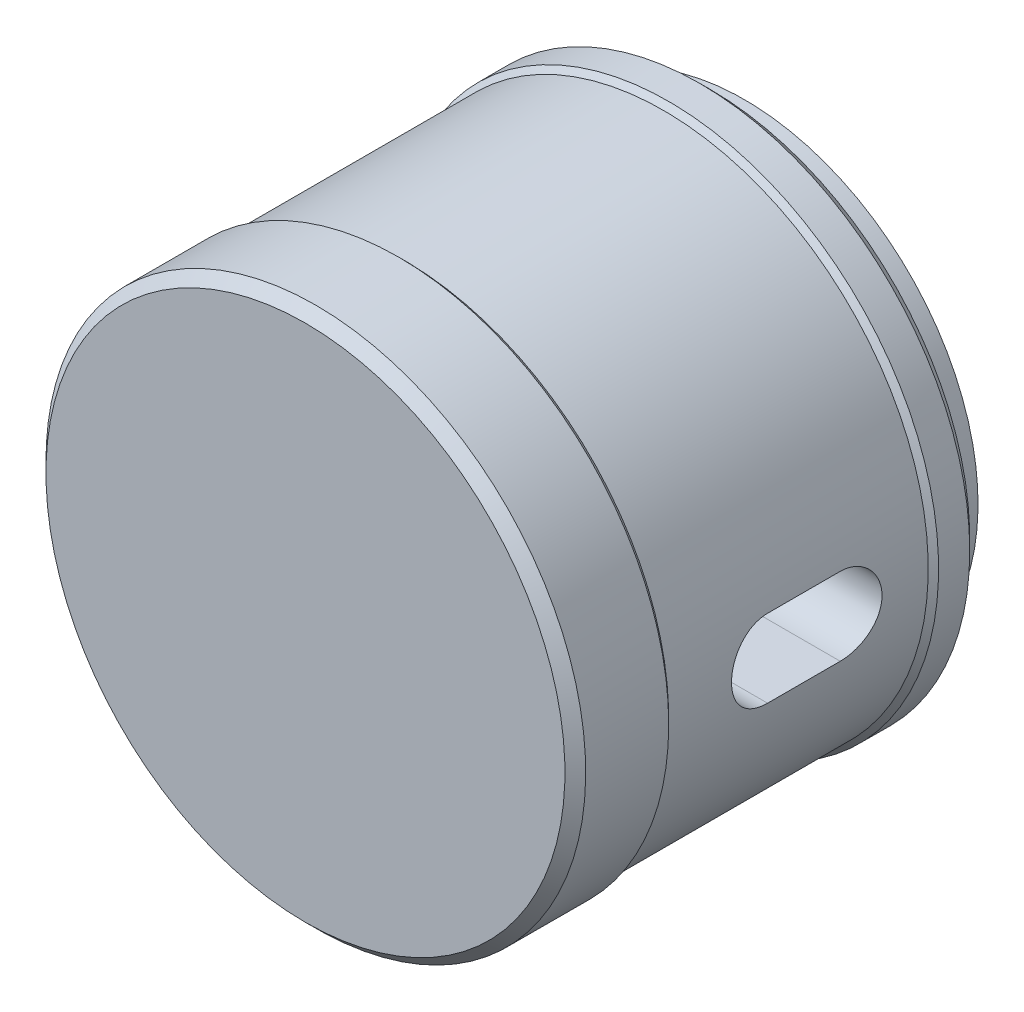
ISO-10303-21;
HEADER;
FILE_DESCRIPTION(('STEP AP214'),'2;1');
FILE_NAME('part.step','',(''),(''),'','','');
FILE_SCHEMA(('AUTOMOTIVE_DESIGN { 1 0 10303 214 1 1 1 1 }'));
ENDSEC;
DATA;
#1=APPLICATION_CONTEXT('core data for automotive mechanical design processes');
#2=APPLICATION_PROTOCOL_DEFINITION('international standard','automotive_design',2000,#1);
#3=PRODUCT_CONTEXT('',#1,'mechanical');
#4=PRODUCT('Part','Part','',(#3));
#5=PRODUCT_RELATED_PRODUCT_CATEGORY('part','',(#4));
#6=PRODUCT_DEFINITION_FORMATION('','',#4);
#7=PRODUCT_DEFINITION_CONTEXT('part definition',#1,'design');
#8=PRODUCT_DEFINITION('design','',#6,#7);
#9=PRODUCT_DEFINITION_SHAPE('','',#8);
#10=(LENGTH_UNIT() NAMED_UNIT(*) SI_UNIT(.MILLI.,.METRE.));
#11=(NAMED_UNIT(*) PLANE_ANGLE_UNIT() SI_UNIT($,.RADIAN.));
#12=(NAMED_UNIT(*) SI_UNIT($,.STERADIAN.) SOLID_ANGLE_UNIT());
#13=UNCERTAINTY_MEASURE_WITH_UNIT(LENGTH_MEASURE(1.E-05),#10,'distance_accuracy_value','');
#14=(GEOMETRIC_REPRESENTATION_CONTEXT(3) GLOBAL_UNCERTAINTY_ASSIGNED_CONTEXT((#13)) GLOBAL_UNIT_ASSIGNED_CONTEXT((#10,
#11,#12)) REPRESENTATION_CONTEXT('',''));
#15=CARTESIAN_POINT('',(0.,0.,0.));
#16=DIRECTION('',(0.,0.,1.));
#17=DIRECTION('',(1.,0.,0.));
#18=AXIS2_PLACEMENT_3D('',#15,#16,#17);
#19=CARTESIAN_POINT('',(0.,0.,-3.));
#20=DIRECTION('',(0.,0.,1.));
#21=DIRECTION('',(0.,1.,0.));
#22=AXIS2_PLACEMENT_3D('',#19,#20,#21);
#23=CYLINDRICAL_SURFACE('',#22,17.5);
#24=CARTESIAN_POINT('',(0.,0.,-41.1));
#25=DIRECTION('',(0.,0.,-1.));
#26=DIRECTION('',(-1.,0.,0.));
#27=AXIS2_PLACEMENT_3D('',#24,#25,#26);
#28=CIRCLE('',#27,17.5);
#29=CARTESIAN_POINT('',(-17.5,0.,-41.1));
#30=VERTEX_POINT('',#29);
#31=EDGE_CURVE('E11',#30,#30,#28,.F.);
#32=ORIENTED_EDGE('',*,*,#31,.F.);
#33=EDGE_LOOP('',(#32));
#34=FACE_BOUND('',#33,.T.);
#35=CARTESIAN_POINT('',(0.,0.,-39.1761195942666));
#36=DIRECTION('',(0.,0.,-1.));
#37=DIRECTION('',(0.,-1.,0.));
#38=AXIS2_PLACEMENT_3D('',#35,#36,#37);
#39=CIRCLE('',#38,17.5);
#40=CARTESIAN_POINT('',(0.,-17.5,-39.1761195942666));
#41=VERTEX_POINT('',#40);
#42=EDGE_CURVE('E674',#41,#41,#39,.T.);
#43=ORIENTED_EDGE('',*,*,#42,.F.);
#44=EDGE_LOOP('',(#43));
#45=FACE_BOUND('',#44,.T.);
#46=ADVANCED_FACE('F17',(#34,#45),#23,.F.);
#47=CARTESIAN_POINT('',(0.,0.,-43.1));
#48=DIRECTION('',(0.,0.,1.));
#49=DIRECTION('',(1.,0.,0.));
#50=AXIS2_PLACEMENT_3D('',#47,#48,#49);
#51=CIRCLE('',#50,17.5);
#52=CARTESIAN_POINT('',(17.5,0.,-43.1));
#53=VERTEX_POINT('',#52);
#54=EDGE_CURVE('E25',#53,#53,#51,.F.);
#55=ORIENTED_EDGE('',*,*,#54,.F.);
#56=EDGE_LOOP('',(#55));
#57=FACE_BOUND('',#56,.T.);
#58=CARTESIAN_POINT('',(0.,0.,-45.3));
#59=DIRECTION('',(0.,0.,-1.));
#60=DIRECTION('',(0.,-1.,0.));
#61=AXIS2_PLACEMENT_3D('',#58,#59,#60);
#62=CIRCLE('',#61,17.5);
#63=CARTESIAN_POINT('',(0.,-17.5,-45.3));
#64=VERTEX_POINT('',#63);
#65=EDGE_CURVE('E250',#64,#64,#62,.T.);
#66=ORIENTED_EDGE('',*,*,#65,.T.);
#67=EDGE_LOOP('',(#66));
#68=FACE_BOUND('',#67,.T.);
#69=ADVANCED_FACE('F337',(#57,#68),#23,.F.);
#70=CARTESIAN_POINT('',(0.,0.,-3.));
#71=DIRECTION('',(0.,0.,1.));
#72=DIRECTION('',(0.,1.,0.));
#73=AXIS2_PLACEMENT_3D('',#70,#71,#72);
#74=CYLINDRICAL_SURFACE('',#73,26.);
#75=CARTESIAN_POINT('',(0.,0.,-38.));
#76=DIRECTION('',(0.,0.,1.));
#77=DIRECTION('',(-1.,0.,0.));
#78=AXIS2_PLACEMENT_3D('',#75,#76,#77);
#79=CIRCLE('',#78,26.);
#80=CARTESIAN_POINT('',(-26.,0.,-38.));
#81=VERTEX_POINT('',#80);
#82=EDGE_CURVE('E241',#81,#81,#79,.T.);
#83=ORIENTED_EDGE('',*,*,#82,.F.);
#84=EDGE_LOOP('',(#83));
#85=FACE_BOUND('',#84,.T.);
#86=CARTESIAN_POINT('',(0.,0.,-41.));
#87=DIRECTION('',(0.,0.,-1.));
#88=DIRECTION('',(0.,-1.,0.));
#89=AXIS2_PLACEMENT_3D('',#86,#87,#88);
#90=CIRCLE('',#89,26.);
#91=CARTESIAN_POINT('',(0.,-26.,-41.));
#92=VERTEX_POINT('',#91);
#93=EDGE_CURVE('E259',#92,#92,#90,.F.);
#94=ORIENTED_EDGE('',*,*,#93,.T.);
#95=EDGE_LOOP('',(#94));
#96=FACE_BOUND('',#95,.T.);
#97=ADVANCED_FACE('F343',(#85,#96),#74,.T.);
#98=CARTESIAN_POINT('',(-17.5,0.,-42.));
#99=DIRECTION('',(0.,0.,-1.));
#100=DIRECTION('',(0.,-1.,0.));
#101=AXIS2_PLACEMENT_3D('',#98,#99,#100);
#102=PLANE('',#101);
#103=CARTESIAN_POINT('',(0.,0.,-42.));
#104=DIRECTION('',(0.,0.,-1.));
#105=DIRECTION('',(0.,-1.,0.));
#106=AXIS2_PLACEMENT_3D('',#103,#104,#105);
#107=CIRCLE('',#106,22.5);
#108=CARTESIAN_POINT('',(0.,-22.5,-42.));
#109=VERTEX_POINT('',#108);
#110=EDGE_CURVE('E244',#109,#109,#107,.T.);
#111=ORIENTED_EDGE('',*,*,#110,.F.);
#112=EDGE_LOOP('',(#111));
#113=FACE_BOUND('',#112,.T.);
#114=CARTESIAN_POINT('',(0.,0.,-42.));
#115=DIRECTION('',(0.,0.,-1.));
#116=DIRECTION('',(0.,-1.,0.));
#117=AXIS2_PLACEMENT_3D('',#114,#115,#116);
#118=CIRCLE('',#117,25.);
#119=CARTESIAN_POINT('',(0.,-25.,-42.));
#120=VERTEX_POINT('',#119);
#121=EDGE_CURVE('E265',#120,#120,#118,.T.);
#122=ORIENTED_EDGE('',*,*,#121,.T.);
#123=EDGE_LOOP('',(#122));
#124=FACE_BOUND('',#123,.T.);
#125=ADVANCED_FACE('F371',(#113,#124),#102,.T.);
#126=CARTESIAN_POINT('',(0.,0.,-41.));
#127=DIRECTION('',(0.,0.,1.));
#128=DIRECTION('',(0.,1.,0.));
#129=AXIS2_PLACEMENT_3D('',#126,#127,#128);
#130=CONICAL_SURFACE('',#129,26.,0.785398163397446);
#131=ORIENTED_EDGE('',*,*,#121,.F.);
#132=EDGE_LOOP('',(#131));
#133=FACE_BOUND('',#132,.T.);
#134=ORIENTED_EDGE('',*,*,#93,.F.);
#135=EDGE_LOOP('',(#134));
#136=FACE_BOUND('',#135,.T.);
#137=ADVANCED_FACE('F19',(#133,#136),#130,.T.);
#138=CARTESIAN_POINT('',(-17.5,0.,-45.3));
#139=DIRECTION('',(0.,0.,1.));
#140=DIRECTION('',(0.,1.,0.));
#141=AXIS2_PLACEMENT_3D('',#138,#139,#140);
#142=PLANE('',#141);
#143=ORIENTED_EDGE('',*,*,#65,.F.);
#144=EDGE_LOOP('',(#143));
#145=FACE_BOUND('',#144,.T.);
#146=CARTESIAN_POINT('',(0.,0.,-45.3));
#147=DIRECTION('',(0.,0.,-1.));
#148=DIRECTION('',(0.,-1.,0.));
#149=AXIS2_PLACEMENT_3D('',#146,#147,#148);
#150=CIRCLE('',#149,22.5);
#151=CARTESIAN_POINT('',(0.,-22.5,-45.3));
#152=VERTEX_POINT('',#151);
#153=EDGE_CURVE('E247',#152,#152,#150,.T.);
#154=ORIENTED_EDGE('',*,*,#153,.T.);
#155=EDGE_LOOP('',(#154));
#156=FACE_BOUND('',#155,.T.);
#157=ADVANCED_FACE('F361',(#145,#156),#142,.F.);
#158=CARTESIAN_POINT('',(0.,0.,-29.0872377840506));
#159=DIRECTION('',(0.,0.,-1.));
#160=DIRECTION('',(0.,-1.,0.));
#161=AXIS2_PLACEMENT_3D('',#158,#159,#160);
#162=CYLINDRICAL_SURFACE('',#161,22.5);
#163=ORIENTED_EDGE('',*,*,#153,.F.);
#164=EDGE_LOOP('',(#163));
#165=FACE_BOUND('',#164,.T.);
#166=ORIENTED_EDGE('',*,*,#110,.T.);
#167=EDGE_LOOP('',(#166));
#168=FACE_BOUND('',#167,.T.);
#169=ADVANCED_FACE('F355',(#165,#168),#162,.T.);
#170=CARTESIAN_POINT('',(-17.5,0.,-17.));
#171=DIRECTION('',(0.,0.,-1.));
#172=DIRECTION('',(0.,-1.,0.));
#173=AXIS2_PLACEMENT_3D('',#170,#171,#172);
#174=PLANE('',#173);
#175=CARTESIAN_POINT('',(0.,0.,-17.));
#176=DIRECTION('',(0.,0.,1.));
#177=DIRECTION('',(0.,1.,0.));
#178=AXIS2_PLACEMENT_3D('',#175,#176,#177);
#179=CIRCLE('',#178,17.5);
#180=CARTESIAN_POINT('',(0.,17.5,-17.));
#181=VERTEX_POINT('',#180);
#182=EDGE_CURVE('E253',#181,#181,#179,.T.);
#183=ORIENTED_EDGE('',*,*,#182,.F.);
#184=EDGE_LOOP('',(#183));
#185=FACE_BOUND('',#184,.T.);
#186=ADVANCED_FACE('F348',(#185),#174,.T.);
#187=CARTESIAN_POINT('',(0.,0.,-31.1761195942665));
#188=DIRECTION('',(0.,0.,1.));
#189=DIRECTION('',(0.,1.,0.));
#190=AXIS2_PLACEMENT_3D('',#187,#188,#189);
#191=CIRCLE('',#190,17.5);
#192=CARTESIAN_POINT('',(17.1961427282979,3.24694860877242,-31.1761195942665));
#193=VERTEX_POINT('',#192);
#194=CARTESIAN_POINT('',(-17.1961427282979,3.24694860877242,-31.1761195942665));
#195=VERTEX_POINT('',#194);
#196=EDGE_CURVE('E107',#193,#195,#191,.T.);
#197=ORIENTED_EDGE('',*,*,#196,.F.);
#198=CARTESIAN_POINT('',(17.0934929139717,3.75,-29.3));
#199=CARTESIAN_POINT('',(17.0934831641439,3.75001150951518,-29.4041782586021));
#200=CARTESIAN_POINT('',(17.0944450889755,3.74565889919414,-29.508350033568));
#201=CARTESIAN_POINT('',(17.0982400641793,3.72831474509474,-29.7159239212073));
#202=CARTESIAN_POINT('',(17.1010728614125,3.71532437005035,-29.8193261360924));
#203=CARTESIAN_POINT('',(17.1085312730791,3.68082226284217,-30.0244644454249));
#204=CARTESIAN_POINT('',(17.1131539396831,3.65932454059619,-30.126202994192));
#205=CARTESIAN_POINT('',(17.1240478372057,3.60800058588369,-30.3274381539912));
#206=CARTESIAN_POINT('',(17.1303190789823,3.57817429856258,-30.4269347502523));
#207=CARTESIAN_POINT('',(17.1513486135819,3.47650690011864,-30.7210297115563));
#208=CARTESIAN_POINT('',(17.168329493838,3.39244778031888,-30.9114070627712));
#209=CARTESIAN_POINT('',(17.2062888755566,3.19432775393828,-31.2752889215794));
#210=CARTESIAN_POINT('',(17.2272679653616,3.08026243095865,-31.4487909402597));
#211=CARTESIAN_POINT('',(17.2712383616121,2.82338589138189,-31.7768922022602));
#212=CARTESIAN_POINT('',(17.2942543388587,2.68018357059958,-31.9311825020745));
#213=CARTESIAN_POINT('',(17.3394905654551,2.36993661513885,-32.2137508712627));
#214=CARTESIAN_POINT('',(17.3617106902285,2.20288826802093,-32.3420248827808));
#215=CARTESIAN_POINT('',(17.4031197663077,1.8476136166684,-32.5701410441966));
#216=CARTESIAN_POINT('',(17.4222759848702,1.65919121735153,-32.6696842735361));
#217=CARTESIAN_POINT('',(17.4551175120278,1.26782482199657,-32.8355729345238));
#218=CARTESIAN_POINT('',(17.4688036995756,1.06488316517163,-32.90192370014));
#219=CARTESIAN_POINT('',(17.4889890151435,0.653470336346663,-32.9985743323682));
#220=CARTESIAN_POINT('',(17.4955931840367,0.445128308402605,-33.029401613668));
#221=CARTESIAN_POINT('',(17.5012340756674,0.0261272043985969,-33.0557782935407));
#222=CARTESIAN_POINT('',(17.5002714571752,-0.184531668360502,-33.0513307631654));
#223=CARTESIAN_POINT('',(17.4909675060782,-0.59854335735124,-33.007677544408));
#224=CARTESIAN_POINT('',(17.4827470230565,-0.801959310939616,-32.9690411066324));
#225=CARTESIAN_POINT('',(17.4599884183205,-1.19935023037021,-32.8590125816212));
#226=CARTESIAN_POINT('',(17.4454500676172,-1.39332485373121,-32.7876193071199));
#227=CARTESIAN_POINT('',(17.4114936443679,-1.76792131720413,-32.6135956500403));
#228=CARTESIAN_POINT('',(17.3920416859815,-1.94843866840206,-32.5107472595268));
#229=CARTESIAN_POINT('',(17.3503940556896,-2.28985801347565,-32.2768888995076));
#230=CARTESIAN_POINT('',(17.3281981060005,-2.45075801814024,-32.1458760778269));
#231=CARTESIAN_POINT('',(17.282986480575,-2.75173292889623,-31.8563554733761));
#232=CARTESIAN_POINT('',(17.2599632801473,-2.89133054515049,-31.6973531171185));
#233=CARTESIAN_POINT('',(17.2160926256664,-3.14204075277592,-31.3578046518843));
#234=CARTESIAN_POINT('',(17.1952457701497,-3.25314552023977,-31.1772526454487));
#235=CARTESIAN_POINT('',(17.1673873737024,-3.39605068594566,-30.893937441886));
#236=CARTESIAN_POINT('',(17.158654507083,-3.43979676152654,-30.7971917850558));
#237=CARTESIAN_POINT('',(17.1425945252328,-3.51896137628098,-30.6002508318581));
#238=CARTESIAN_POINT('',(17.1352668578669,-3.55438318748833,-30.5000569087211));
#239=CARTESIAN_POINT('',(17.1222467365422,-3.61658343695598,-30.2970406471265));
#240=CARTESIAN_POINT('',(17.1165525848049,-3.64337085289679,-30.1942211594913));
#241=CARTESIAN_POINT('',(17.1069644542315,-3.68812841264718,-29.9866388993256));
#242=CARTESIAN_POINT('',(17.1030696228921,-3.70610273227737,-29.8818770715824));
#243=CARTESIAN_POINT('',(17.0979312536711,-3.72972604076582,-29.697486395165));
#244=CARTESIAN_POINT('',(17.0962685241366,-3.73733199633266,-29.6181140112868));
#245=CARTESIAN_POINT('',(17.0940487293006,-3.74746634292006,-29.4591634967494));
#246=CARTESIAN_POINT('',(17.0934898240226,-3.7500031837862,-29.3795859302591));
#247=CARTESIAN_POINT('',(17.0934929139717,-3.75,-29.3));
#248=B_SPLINE_CURVE_WITH_KNOTS('',3,(#198,#199,#200,#201,#202,#203,#204,#205,#206,#207,#208,
#209,#210,#211,#212,#213,#214,#215,#216,#217,#218,#219,#220,#221,#222,#223,#224,#225,#226,#227,
#228,#229,#230,#231,#232,#233,#234,#235,#236,#237,#238,#239,#240,#241,#242,#243,#244,#245,#246,
#247),.UNSPECIFIED.,.F.,.F.,(4,2,2,2,2,2,2,2,2,2,2,2,2,2,2,2,2,2,2,2,2,2,2,2,4),(0.,
0.312428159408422,0.624814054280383,0.936687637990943,1.24856327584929,1.87179193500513,
2.49511237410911,3.12742860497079,3.75984338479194,4.39861850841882,5.03729094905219,
5.66635367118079,6.2953616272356,6.91408952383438,7.53283984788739,8.1559796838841,
8.77918265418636,9.41476795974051,10.0505276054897,10.3698114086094,10.6889694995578,
11.0077946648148,11.326468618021,11.5655666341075,11.804265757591),.UNSPECIFIED.);
#249=CARTESIAN_POINT('',(17.0934929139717,3.75,-29.3));
#250=VERTEX_POINT('',#249);
#251=EDGE_CURVE('E133',#250,#193,#248,.T.);
#252=ORIENTED_EDGE('',*,*,#251,.F.);
#253=DIRECTION('',(0.,0.,1.));
#254=VECTOR('',#253,1.);
#255=CARTESIAN_POINT('',(17.0934929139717,3.75,-3.));
#256=LINE('',#255,#254);
#257=CARTESIAN_POINT('',(17.0934929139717,3.75,-22.3));
#258=VERTEX_POINT('',#257);
#259=EDGE_CURVE('E292',#258,#250,#256,.F.);
#260=ORIENTED_EDGE('',*,*,#259,.F.);
#261=CARTESIAN_POINT('',(17.0934929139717,-3.75,-22.3));
#262=CARTESIAN_POINT('',(17.0934831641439,-3.75001150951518,-22.1958217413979));
#263=CARTESIAN_POINT('',(17.0944450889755,-3.74565889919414,-22.091649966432));
#264=CARTESIAN_POINT('',(17.0982400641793,-3.72831474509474,-21.8840760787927));
#265=CARTESIAN_POINT('',(17.1010728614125,-3.71532437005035,-21.7806738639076));
#266=CARTESIAN_POINT('',(17.1085312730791,-3.68082226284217,-21.5755355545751));
#267=CARTESIAN_POINT('',(17.1131539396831,-3.65932454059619,-21.473797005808));
#268=CARTESIAN_POINT('',(17.1240478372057,-3.60800058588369,-21.2725618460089));
#269=CARTESIAN_POINT('',(17.1303190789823,-3.57817429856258,-21.1730652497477));
#270=CARTESIAN_POINT('',(17.1513486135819,-3.47650690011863,-20.8789702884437));
#271=CARTESIAN_POINT('',(17.168329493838,-3.39244778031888,-20.6885929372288));
#272=CARTESIAN_POINT('',(17.2062888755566,-3.19432775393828,-20.3247110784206));
#273=CARTESIAN_POINT('',(17.2272679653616,-3.08026243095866,-20.1512090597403));
#274=CARTESIAN_POINT('',(17.2712383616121,-2.8233858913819,-19.8231077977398));
#275=CARTESIAN_POINT('',(17.2942543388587,-2.68018357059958,-19.6688174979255));
#276=CARTESIAN_POINT('',(17.3394905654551,-2.36993661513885,-19.3862491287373));
#277=CARTESIAN_POINT('',(17.3617106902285,-2.20288826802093,-19.2579751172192));
#278=CARTESIAN_POINT('',(17.4031197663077,-1.8476136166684,-19.0298589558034));
#279=CARTESIAN_POINT('',(17.4222759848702,-1.65919121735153,-18.9303157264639));
#280=CARTESIAN_POINT('',(17.4551175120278,-1.26782482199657,-18.7644270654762));
#281=CARTESIAN_POINT('',(17.4688036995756,-1.06488316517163,-18.69807629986));
#282=CARTESIAN_POINT('',(17.4889890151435,-0.653470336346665,-18.6014256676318));
#283=CARTESIAN_POINT('',(17.4955931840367,-0.445128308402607,-18.570598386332));
#284=CARTESIAN_POINT('',(17.5012340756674,-0.0261272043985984,-18.5442217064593));
#285=CARTESIAN_POINT('',(17.5002714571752,0.1845316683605,-18.5486692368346));
#286=CARTESIAN_POINT('',(17.4909675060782,0.598543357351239,-18.592322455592));
#287=CARTESIAN_POINT('',(17.4827470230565,0.801959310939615,-18.6309588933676));
#288=CARTESIAN_POINT('',(17.4599884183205,1.19935023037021,-18.7409874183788));
#289=CARTESIAN_POINT('',(17.4454500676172,1.39332485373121,-18.8123806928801));
#290=CARTESIAN_POINT('',(17.4114936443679,1.76792131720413,-18.9864043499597));
#291=CARTESIAN_POINT('',(17.3920416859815,1.94843866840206,-19.0892527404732));
#292=CARTESIAN_POINT('',(17.3503940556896,2.28985801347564,-19.3231111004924));
#293=CARTESIAN_POINT('',(17.3281981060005,2.45075801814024,-19.4541239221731));
#294=CARTESIAN_POINT('',(17.282986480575,2.75173292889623,-19.7436445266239));
#295=CARTESIAN_POINT('',(17.2599632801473,2.89133054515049,-19.9026468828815));
#296=CARTESIAN_POINT('',(17.2160926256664,3.14204075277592,-20.2421953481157));
#297=CARTESIAN_POINT('',(17.1952457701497,3.25314552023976,-20.4227473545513));
#298=CARTESIAN_POINT('',(17.1673873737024,3.39605068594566,-20.706062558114));
#299=CARTESIAN_POINT('',(17.158654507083,3.43979676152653,-20.8028082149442));
#300=CARTESIAN_POINT('',(17.1425945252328,3.51896137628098,-20.9997491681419));
#301=CARTESIAN_POINT('',(17.1352668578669,3.55438318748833,-21.0999430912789));
#302=CARTESIAN_POINT('',(17.1222467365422,3.61658343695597,-21.3029593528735));
#303=CARTESIAN_POINT('',(17.1165525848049,3.64337085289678,-21.4057788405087));
#304=CARTESIAN_POINT('',(17.1069644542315,3.68812841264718,-21.6133611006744));
#305=CARTESIAN_POINT('',(17.1030696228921,3.70610273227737,-21.7181229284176));
#306=CARTESIAN_POINT('',(17.0979312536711,3.72972604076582,-21.902513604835));
#307=CARTESIAN_POINT('',(17.0962685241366,3.73733199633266,-21.9818859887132));
#308=CARTESIAN_POINT('',(17.0940487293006,3.74746634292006,-22.1408365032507));
#309=CARTESIAN_POINT('',(17.0934898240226,3.7500031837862,-22.2204140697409));
#310=CARTESIAN_POINT('',(17.0934929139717,3.75,-22.3));
#311=B_SPLINE_CURVE_WITH_KNOTS('',3,(#261,#262,#263,#264,#265,#266,#267,#268,#269,#270,#271,
#272,#273,#274,#275,#276,#277,#278,#279,#280,#281,#282,#283,#284,#285,#286,#287,#288,#289,#290,
#291,#292,#293,#294,#295,#296,#297,#298,#299,#300,#301,#302,#303,#304,#305,#306,#307,#308,#309,
#310),.UNSPECIFIED.,.F.,.F.,(4,2,2,2,2,2,2,2,2,2,2,2,2,2,2,2,2,2,2,2,2,2,2,2,4),(0.,
0.312428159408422,0.62481405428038,0.936687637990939,1.24856327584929,1.87179193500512,
2.49511237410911,3.12742860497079,3.75984338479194,4.39861850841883,5.03729094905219,
5.66635367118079,6.2953616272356,6.91408952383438,7.53283984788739,8.1559796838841,
8.77918265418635,9.4147679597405,10.0505276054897,10.3698114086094,10.6889694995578,
11.0077946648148,11.326468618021,11.5655666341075,11.804265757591),.UNSPECIFIED.);
#312=CARTESIAN_POINT('',(17.0934929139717,-3.75,-22.3));
#313=VERTEX_POINT('',#312);
#314=EDGE_CURVE('E219',#313,#258,#311,.T.);
#315=ORIENTED_EDGE('',*,*,#314,.F.);
#316=DIRECTION('',(0.,0.,1.));
#317=VECTOR('',#316,1.);
#318=CARTESIAN_POINT('',(17.0934929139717,-3.75,-3.));
#319=LINE('',#318,#317);
#320=CARTESIAN_POINT('',(17.0934929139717,-3.75,-29.3));
#321=VERTEX_POINT('',#320);
#322=EDGE_CURVE('E124',#321,#313,#319,.T.);
#323=ORIENTED_EDGE('',*,*,#322,.F.);
#324=CARTESIAN_POINT('',(17.1961427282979,-3.24694860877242,-31.1761195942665));
#325=VERTEX_POINT('',#324);
#326=EDGE_CURVE('E116',#325,#321,#248,.T.);
#327=ORIENTED_EDGE('',*,*,#326,.F.);
#328=CARTESIAN_POINT('',(-17.1961427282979,-3.24694860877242,-31.1761195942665));
#329=VERTEX_POINT('',#328);
#330=EDGE_CURVE('E104',#329,#325,#191,.T.);
#331=ORIENTED_EDGE('',*,*,#330,.F.);
#332=CARTESIAN_POINT('',(-17.0934929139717,-3.75,-29.3));
#333=CARTESIAN_POINT('',(-17.0934831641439,-3.75001150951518,-29.4041782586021));
#334=CARTESIAN_POINT('',(-17.0944450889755,-3.74565889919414,-29.508350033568));
#335=CARTESIAN_POINT('',(-17.0982400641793,-3.72831474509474,-29.7159239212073));
#336=CARTESIAN_POINT('',(-17.1010728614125,-3.71532437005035,-29.8193261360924));
#337=CARTESIAN_POINT('',(-17.1085312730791,-3.68082226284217,-30.0244644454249));
#338=CARTESIAN_POINT('',(-17.1131539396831,-3.65932454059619,-30.126202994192));
#339=CARTESIAN_POINT('',(-17.1240478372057,-3.60800058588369,-30.3274381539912));
#340=CARTESIAN_POINT('',(-17.1303190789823,-3.57817429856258,-30.4269347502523));
#341=CARTESIAN_POINT('',(-17.1513486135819,-3.47650690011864,-30.7210297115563));
#342=CARTESIAN_POINT('',(-17.168329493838,-3.39244778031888,-30.9114070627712));
#343=CARTESIAN_POINT('',(-17.2062888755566,-3.19432775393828,-31.2752889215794));
#344=CARTESIAN_POINT('',(-17.2272679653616,-3.08026243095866,-31.4487909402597));
#345=CARTESIAN_POINT('',(-17.2712383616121,-2.8233858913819,-31.7768922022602));
#346=CARTESIAN_POINT('',(-17.2942543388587,-2.68018357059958,-31.9311825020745));
#347=CARTESIAN_POINT('',(-17.3394905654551,-2.36993661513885,-32.2137508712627));
#348=CARTESIAN_POINT('',(-17.3617106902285,-2.20288826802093,-32.3420248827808));
#349=CARTESIAN_POINT('',(-17.4031197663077,-1.8476136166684,-32.5701410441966));
#350=CARTESIAN_POINT('',(-17.4222759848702,-1.65919121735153,-32.6696842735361));
#351=CARTESIAN_POINT('',(-17.4551175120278,-1.26782482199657,-32.8355729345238));
#352=CARTESIAN_POINT('',(-17.4688036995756,-1.06488316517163,-32.90192370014));
#353=CARTESIAN_POINT('',(-17.4889890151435,-0.653470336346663,-32.9985743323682));
#354=CARTESIAN_POINT('',(-17.4955931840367,-0.445128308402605,-33.029401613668));
#355=CARTESIAN_POINT('',(-17.5012340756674,-0.0261272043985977,-33.0557782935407));
#356=CARTESIAN_POINT('',(-17.5002714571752,0.184531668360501,-33.0513307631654));
#357=CARTESIAN_POINT('',(-17.4909675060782,0.598543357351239,-33.007677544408));
#358=CARTESIAN_POINT('',(-17.4827470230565,0.801959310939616,-32.9690411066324));
#359=CARTESIAN_POINT('',(-17.4599884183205,1.19935023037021,-32.8590125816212));
#360=CARTESIAN_POINT('',(-17.4454500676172,1.39332485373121,-32.7876193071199));
#361=CARTESIAN_POINT('',(-17.4114936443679,1.76792131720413,-32.6135956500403));
#362=CARTESIAN_POINT('',(-17.3920416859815,1.94843866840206,-32.5107472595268));
#363=CARTESIAN_POINT('',(-17.3503940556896,2.28985801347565,-32.2768888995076));
#364=CARTESIAN_POINT('',(-17.3281981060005,2.45075801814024,-32.1458760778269));
#365=CARTESIAN_POINT('',(-17.282986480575,2.75173292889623,-31.8563554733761));
#366=CARTESIAN_POINT('',(-17.2599632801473,2.89133054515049,-31.6973531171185));
#367=CARTESIAN_POINT('',(-17.2160926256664,3.14204075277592,-31.3578046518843));
#368=CARTESIAN_POINT('',(-17.1952457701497,3.25314552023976,-31.1772526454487));
#369=CARTESIAN_POINT('',(-17.1673873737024,3.39605068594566,-30.893937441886));
#370=CARTESIAN_POINT('',(-17.158654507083,3.43979676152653,-30.7971917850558));
#371=CARTESIAN_POINT('',(-17.1425945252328,3.51896137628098,-30.6002508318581));
#372=CARTESIAN_POINT('',(-17.1352668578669,3.55438318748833,-30.5000569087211));
#373=CARTESIAN_POINT('',(-17.1222467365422,3.61658343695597,-30.2970406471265));
#374=CARTESIAN_POINT('',(-17.1165525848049,3.64337085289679,-30.1942211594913));
#375=CARTESIAN_POINT('',(-17.1069644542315,3.68812841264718,-29.9866388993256));
#376=CARTESIAN_POINT('',(-17.1030696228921,3.70610273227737,-29.8818770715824));
#377=CARTESIAN_POINT('',(-17.0979312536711,3.72972604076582,-29.697486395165));
#378=CARTESIAN_POINT('',(-17.0962685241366,3.73733199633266,-29.6181140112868));
#379=CARTESIAN_POINT('',(-17.0940487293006,3.74746634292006,-29.4591634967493));
#380=CARTESIAN_POINT('',(-17.0934898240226,3.7500031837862,-29.3795859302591));
#381=CARTESIAN_POINT('',(-17.0934929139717,3.75,-29.3));
#382=B_SPLINE_CURVE_WITH_KNOTS('',3,(#332,#333,#334,#335,#336,#337,#338,#339,#340,#341,#342,
#343,#344,#345,#346,#347,#348,#349,#350,#351,#352,#353,#354,#355,#356,#357,#358,#359,#360,#361,
#362,#363,#364,#365,#366,#367,#368,#369,#370,#371,#372,#373,#374,#375,#376,#377,#378,#379,#380,
#381),.UNSPECIFIED.,.F.,.F.,(4,2,2,2,2,2,2,2,2,2,2,2,2,2,2,2,2,2,2,2,2,2,2,2,4),(0.,
0.312428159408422,0.624814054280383,0.936687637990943,1.2485632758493,1.87179193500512,
2.49511237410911,3.12742860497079,3.75984338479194,4.39861850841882,5.03729094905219,
5.66635367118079,6.2953616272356,6.91408952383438,7.53283984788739,8.1559796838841,
8.77918265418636,9.4147679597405,10.0505276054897,10.3698114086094,10.6889694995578,
11.0077946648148,11.326468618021,11.5655666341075,11.804265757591),.UNSPECIFIED.);
#383=CARTESIAN_POINT('',(-17.0934929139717,-3.75,-29.3));
#384=VERTEX_POINT('',#383);
#385=EDGE_CURVE('E96',#384,#329,#382,.T.);
#386=ORIENTED_EDGE('',*,*,#385,.F.);
#387=DIRECTION('',(0.,0.,1.));
#388=VECTOR('',#387,1.);
#389=CARTESIAN_POINT('',(-17.0934929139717,-3.75,-3.));
#390=LINE('',#389,#388);
#391=CARTESIAN_POINT('',(-17.0934929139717,-3.75,-22.3));
#392=VERTEX_POINT('',#391);
#393=EDGE_CURVE('E123',#392,#384,#390,.F.);
#394=ORIENTED_EDGE('',*,*,#393,.F.);
#395=CARTESIAN_POINT('',(-17.0934929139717,3.75,-22.3));
#396=CARTESIAN_POINT('',(-17.0934831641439,3.75001150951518,-22.1958217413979));
#397=CARTESIAN_POINT('',(-17.0944450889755,3.74565889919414,-22.091649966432));
#398=CARTESIAN_POINT('',(-17.0982400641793,3.72831474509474,-21.8840760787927));
#399=CARTESIAN_POINT('',(-17.1010728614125,3.71532437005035,-21.7806738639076));
#400=CARTESIAN_POINT('',(-17.1085312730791,3.68082226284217,-21.5755355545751));
#401=CARTESIAN_POINT('',(-17.1131539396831,3.65932454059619,-21.473797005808));
#402=CARTESIAN_POINT('',(-17.1240478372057,3.60800058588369,-21.2725618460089));
#403=CARTESIAN_POINT('',(-17.1303190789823,3.57817429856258,-21.1730652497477));
#404=CARTESIAN_POINT('',(-17.1513486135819,3.47650690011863,-20.8789702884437));
#405=CARTESIAN_POINT('',(-17.168329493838,3.39244778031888,-20.6885929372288));
#406=CARTESIAN_POINT('',(-17.2062888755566,3.19432775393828,-20.3247110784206));
#407=CARTESIAN_POINT('',(-17.2272679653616,3.08026243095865,-20.1512090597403));
#408=CARTESIAN_POINT('',(-17.2712383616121,2.82338589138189,-19.8231077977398));
#409=CARTESIAN_POINT('',(-17.2942543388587,2.68018357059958,-19.6688174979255));
#410=CARTESIAN_POINT('',(-17.3394905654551,2.36993661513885,-19.3862491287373));
#411=CARTESIAN_POINT('',(-17.3617106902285,2.20288826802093,-19.2579751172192));
#412=CARTESIAN_POINT('',(-17.4031197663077,1.8476136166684,-19.0298589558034));
#413=CARTESIAN_POINT('',(-17.4222759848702,1.65919121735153,-18.9303157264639));
#414=CARTESIAN_POINT('',(-17.4551175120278,1.26782482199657,-18.7644270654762));
#415=CARTESIAN_POINT('',(-17.4688036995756,1.06488316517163,-18.69807629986));
#416=CARTESIAN_POINT('',(-17.4889890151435,0.653470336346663,-18.6014256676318));
#417=CARTESIAN_POINT('',(-17.4955931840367,0.445128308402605,-18.570598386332));
#418=CARTESIAN_POINT('',(-17.5012340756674,0.0261272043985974,-18.5442217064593));
#419=CARTESIAN_POINT('',(-17.5002714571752,-0.184531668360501,-18.5486692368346));
#420=CARTESIAN_POINT('',(-17.4909675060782,-0.598543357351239,-18.592322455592));
#421=CARTESIAN_POINT('',(-17.4827470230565,-0.801959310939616,-18.6309588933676));
#422=CARTESIAN_POINT('',(-17.4599884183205,-1.19935023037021,-18.7409874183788));
#423=CARTESIAN_POINT('',(-17.4454500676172,-1.39332485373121,-18.8123806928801));
#424=CARTESIAN_POINT('',(-17.4114936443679,-1.76792131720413,-18.9864043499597));
#425=CARTESIAN_POINT('',(-17.3920416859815,-1.94843866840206,-19.0892527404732));
#426=CARTESIAN_POINT('',(-17.3503940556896,-2.28985801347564,-19.3231111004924));
#427=CARTESIAN_POINT('',(-17.3281981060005,-2.45075801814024,-19.4541239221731));
#428=CARTESIAN_POINT('',(-17.282986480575,-2.75173292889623,-19.7436445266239));
#429=CARTESIAN_POINT('',(-17.2599632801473,-2.89133054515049,-19.9026468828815));
#430=CARTESIAN_POINT('',(-17.2160926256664,-3.14204075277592,-20.2421953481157));
#431=CARTESIAN_POINT('',(-17.1952457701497,-3.25314552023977,-20.4227473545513));
#432=CARTESIAN_POINT('',(-17.1673873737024,-3.39605068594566,-20.706062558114));
#433=CARTESIAN_POINT('',(-17.158654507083,-3.43979676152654,-20.8028082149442));
#434=CARTESIAN_POINT('',(-17.1425945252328,-3.51896137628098,-20.9997491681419));
#435=CARTESIAN_POINT('',(-17.1352668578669,-3.55438318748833,-21.0999430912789));
#436=CARTESIAN_POINT('',(-17.1222467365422,-3.61658343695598,-21.3029593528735));
#437=CARTESIAN_POINT('',(-17.1165525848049,-3.64337085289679,-21.4057788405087));
#438=CARTESIAN_POINT('',(-17.1069644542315,-3.68812841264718,-21.6133611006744));
#439=CARTESIAN_POINT('',(-17.1030696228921,-3.70610273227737,-21.7181229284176));
#440=CARTESIAN_POINT('',(-17.0979312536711,-3.72972604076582,-21.902513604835));
#441=CARTESIAN_POINT('',(-17.0962685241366,-3.73733199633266,-21.9818859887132));
#442=CARTESIAN_POINT('',(-17.0940487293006,-3.74746634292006,-22.1408365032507));
#443=CARTESIAN_POINT('',(-17.0934898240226,-3.7500031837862,-22.2204140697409));
#444=CARTESIAN_POINT('',(-17.0934929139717,-3.75,-22.3));
#445=B_SPLINE_CURVE_WITH_KNOTS('',3,(#395,#396,#397,#398,#399,#400,#401,#402,#403,#404,#405,
#406,#407,#408,#409,#410,#411,#412,#413,#414,#415,#416,#417,#418,#419,#420,#421,#422,#423,#424,
#425,#426,#427,#428,#429,#430,#431,#432,#433,#434,#435,#436,#437,#438,#439,#440,#441,#442,#443,
#444),.UNSPECIFIED.,.F.,.F.,(4,2,2,2,2,2,2,2,2,2,2,2,2,2,2,2,2,2,2,2,2,2,2,2,4),(0.,
0.312428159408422,0.624814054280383,0.936687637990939,1.24856327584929,1.87179193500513,
2.49511237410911,3.12742860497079,3.75984338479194,4.39861850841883,5.03729094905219,
5.66635367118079,6.2953616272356,6.91408952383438,7.53283984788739,8.15597968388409,
8.77918265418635,9.4147679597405,10.0505276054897,10.3698114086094,10.6889694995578,
11.0077946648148,11.326468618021,11.5655666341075,11.804265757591),.UNSPECIFIED.);
#446=CARTESIAN_POINT('',(-17.0934929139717,3.75,-22.3));
#447=VERTEX_POINT('',#446);
#448=EDGE_CURVE('E226',#447,#392,#445,.T.);
#449=ORIENTED_EDGE('',*,*,#448,.F.);
#450=DIRECTION('',(0.,0.,1.));
#451=VECTOR('',#450,1.);
#452=CARTESIAN_POINT('',(-17.0934929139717,3.75,-3.));
#453=LINE('',#452,#451);
#454=CARTESIAN_POINT('',(-17.0934929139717,3.75,-29.3));
#455=VERTEX_POINT('',#454);
#456=EDGE_CURVE('E138',#455,#447,#453,.T.);
#457=ORIENTED_EDGE('',*,*,#456,.F.);
#458=EDGE_CURVE('E39',#195,#455,#382,.T.);
#459=ORIENTED_EDGE('',*,*,#458,.F.);
#460=EDGE_LOOP('',(#197,#252,#260,#315,#323,#327,#331,#386,#394,#449,#457,#459));
#461=FACE_BOUND('',#460,.T.);
#462=ORIENTED_EDGE('',*,*,#182,.T.);
#463=EDGE_LOOP('',(#462));
#464=FACE_BOUND('',#463,.T.);
#465=ADVANCED_FACE('F112',(#461,#464),#23,.F.);
#466=CARTESIAN_POINT('',(0.,0.,-38.));
#467=DIRECTION('',(0.,0.,-1.));
#468=DIRECTION('',(1.,0.,0.));
#469=AXIS2_PLACEMENT_3D('',#466,#467,#468);
#470=CONICAL_SURFACE('',#469,26.,0.785398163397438);
#471=CARTESIAN_POINT('',(0.,0.,-37.5));
#472=DIRECTION('',(0.,0.,1.));
#473=DIRECTION('',(-1.,0.,0.));
#474=AXIS2_PLACEMENT_3D('',#471,#472,#473);
#475=CIRCLE('',#474,25.5);
#476=CARTESIAN_POINT('',(-25.5,0.,-37.5));
#477=VERTEX_POINT('',#476);
#478=EDGE_CURVE('E238',#477,#477,#475,.T.);
#479=ORIENTED_EDGE('',*,*,#478,.F.);
#480=EDGE_LOOP('',(#479));
#481=FACE_BOUND('',#480,.T.);
#482=ORIENTED_EDGE('',*,*,#82,.T.);
#483=EDGE_LOOP('',(#482));
#484=FACE_BOUND('',#483,.T.);
#485=ADVANCED_FACE('F191',(#481,#484),#470,.T.);
#486=CARTESIAN_POINT('',(0.,0.,-3.));
#487=DIRECTION('',(0.,0.,1.));
#488=DIRECTION('',(-1.,0.,0.));
#489=AXIS2_PLACEMENT_3D('',#486,#487,#488);
#490=CYLINDRICAL_SURFACE('',#489,25.5);
#491=DIRECTION('',(0.,0.,1.));
#492=VECTOR('',#491,1.);
#493=CARTESIAN_POINT('',(-25.2227575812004,3.75,-3.));
#494=LINE('',#493,#492);
#495=CARTESIAN_POINT('',(-25.2227575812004,3.75,-29.3));
#496=VERTEX_POINT('',#495);
#497=CARTESIAN_POINT('',(-25.2227575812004,3.75,-22.3));
#498=VERTEX_POINT('',#497);
#499=EDGE_CURVE('E182',#496,#498,#494,.T.);
#500=ORIENTED_EDGE('',*,*,#499,.T.);
#501=CARTESIAN_POINT('',(-25.2227575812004,3.75,-22.3));
#502=CARTESIAN_POINT('',(-25.2227510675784,3.75001076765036,-22.1951350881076));
#503=CARTESIAN_POINT('',(-25.2234114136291,3.74560142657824,-22.0902757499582));
#504=CARTESIAN_POINT('',(-25.2260176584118,3.72802596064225,-21.8813185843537));
#505=CARTESIAN_POINT('',(-25.2279634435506,3.71486060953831,-21.7772206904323));
#506=CARTESIAN_POINT('',(-25.2330894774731,3.67987658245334,-21.5706363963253));
#507=CARTESIAN_POINT('',(-25.2362683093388,3.65806783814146,-21.4681482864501));
#508=CARTESIAN_POINT('',(-25.2437630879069,3.60598269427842,-21.2654193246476));
#509=CARTESIAN_POINT('',(-25.2480790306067,3.57570632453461,-21.1651784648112));
#510=CARTESIAN_POINT('',(-25.2625610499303,3.47245098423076,-20.8688294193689));
#511=CARTESIAN_POINT('',(-25.2742647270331,3.38702390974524,-20.6769664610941));
#512=CARTESIAN_POINT('',(-25.3004429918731,3.1855660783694,-20.3104083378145));
#513=CARTESIAN_POINT('',(-25.3149174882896,3.06953633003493,-20.135712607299));
#514=CARTESIAN_POINT('',(-25.3451309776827,2.80919564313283,-19.806980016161));
#515=CARTESIAN_POINT('',(-25.3608778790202,2.66469828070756,-19.6530912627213));
#516=CARTESIAN_POINT('',(-25.3917925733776,2.35191830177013,-19.3716456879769));
#517=CARTESIAN_POINT('',(-25.4069602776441,2.18363205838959,-19.244092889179));
#518=CARTESIAN_POINT('',(-25.4350894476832,1.82710103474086,-19.0183980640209));
#519=CARTESIAN_POINT('',(-25.4480404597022,1.63876813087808,-18.9203938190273));
#520=CARTESIAN_POINT('',(-25.4701878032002,1.24810398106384,-18.7574699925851));
#521=CARTESIAN_POINT('',(-25.4793845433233,1.04577426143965,-18.6925468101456));
#522=CARTESIAN_POINT('',(-25.4929317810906,0.634395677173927,-18.59807350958));
#523=CARTESIAN_POINT('',(-25.4973166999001,0.425405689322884,-18.568272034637));
#524=CARTESIAN_POINT('',(-25.5008642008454,0.00534344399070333,-18.5441078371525));
#525=CARTESIAN_POINT('',(-25.5000269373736,-0.20572875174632,-18.549744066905));
#526=CARTESIAN_POINT('',(-25.4932517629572,-0.622238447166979,-18.5960978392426));
#527=CARTESIAN_POINT('',(-25.4873533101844,-0.827706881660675,-18.6365440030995));
#528=CARTESIAN_POINT('',(-25.4711625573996,-1.22890698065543,-18.7509432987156));
#529=CARTESIAN_POINT('',(-25.46087017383,-1.42463845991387,-18.8248970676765));
#530=CARTESIAN_POINT('',(-25.4369799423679,-1.80163715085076,-19.00449392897));
#531=CARTESIAN_POINT('',(-25.4233701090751,-1.98284867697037,-19.1102522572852));
#532=CARTESIAN_POINT('',(-25.3943633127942,-2.32504754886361,-19.3503642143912));
#533=CARTESIAN_POINT('',(-25.3789663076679,-2.48603441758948,-19.4847185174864));
#534=CARTESIAN_POINT('',(-25.3479325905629,-2.78480337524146,-19.7797147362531));
#535=CARTESIAN_POINT('',(-25.3322949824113,-2.92235495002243,-19.9405902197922));
#536=CARTESIAN_POINT('',(-25.3026783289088,-3.16857911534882,-20.2832788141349));
#537=CARTESIAN_POINT('',(-25.2886997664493,-3.27724330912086,-20.4650979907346));
#538=CARTESIAN_POINT('',(-25.2639818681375,-3.46266616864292,-20.8449749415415));
#539=CARTESIAN_POINT('',(-25.2532467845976,-3.5393829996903,-21.0430536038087));
#540=CARTESIAN_POINT('',(-25.2405301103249,-3.62856614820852,-21.3475116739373));
#541=CARTESIAN_POINT('',(-25.2368558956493,-3.65397630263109,-21.4502021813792));
#542=CARTESIAN_POINT('',(-25.2307307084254,-3.69603746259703,-21.6573844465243));
#543=CARTESIAN_POINT('',(-25.2282791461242,-3.71269269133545,-21.7618753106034));
#544=CARTESIAN_POINT('',(-25.2252410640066,-3.73326699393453,-21.9387984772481));
#545=CARTESIAN_POINT('',(-25.2243103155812,-3.73954531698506,-22.0109614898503));
#546=CARTESIAN_POINT('',(-25.2230685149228,-3.74790880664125,-22.1554133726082));
#547=CARTESIAN_POINT('',(-25.2227564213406,-3.75000101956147,-22.2277018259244));
#548=CARTESIAN_POINT('',(-25.2227575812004,-3.75,-22.3));
#549=B_SPLINE_CURVE_WITH_KNOTS('',3,(#501,#502,#503,#504,#505,#506,#507,#508,#509,#510,#511,
#512,#513,#514,#515,#516,#517,#518,#519,#520,#521,#522,#523,#524,#525,#526,#527,#528,#529,#530,
#531,#532,#533,#534,#535,#536,#537,#538,#539,#540,#541,#542,#543,#544,#545,#546,#547,#548),
.UNSPECIFIED.,.F.,.F.,(4,2,2,2,2,2,2,2,2,2,2,2,2,2,2,2,2,2,2,2,2,2,2,4),(0.,0.314490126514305,
0.628952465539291,0.943054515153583,1.25715545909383,1.88497165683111,2.51276716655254,
3.14481939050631,3.77696808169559,4.41202037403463,5.04700352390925,5.6774141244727,
6.30780608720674,6.93332756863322,7.55886094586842,8.18668866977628,8.81453119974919,
9.44823149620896,10.0821157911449,10.7168275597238,11.034070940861,11.3511611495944,
11.5683714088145,11.7852157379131),.UNSPECIFIED.);
#550=CARTESIAN_POINT('',(-25.2227575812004,-3.75,-22.3));
#551=VERTEX_POINT('',#550);
#552=EDGE_CURVE('E213',#498,#551,#549,.T.);
#553=ORIENTED_EDGE('',*,*,#552,.T.);
#554=DIRECTION('',(0.,0.,1.));
#555=VECTOR('',#554,1.);
#556=CARTESIAN_POINT('',(-25.2227575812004,-3.75,-3.));
#557=LINE('',#556,#555);
#558=CARTESIAN_POINT('',(-25.2227575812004,-3.75,-29.3));
#559=VERTEX_POINT('',#558);
#560=EDGE_CURVE('E181',#551,#559,#557,.F.);
#561=ORIENTED_EDGE('',*,*,#560,.T.);
#562=CARTESIAN_POINT('',(-25.2227575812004,-3.75,-29.3));
#563=CARTESIAN_POINT('',(-25.2227510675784,-3.75001076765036,-29.4048649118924));
#564=CARTESIAN_POINT('',(-25.2234114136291,-3.74560142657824,-29.5097242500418));
#565=CARTESIAN_POINT('',(-25.2260176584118,-3.72802596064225,-29.7186814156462));
#566=CARTESIAN_POINT('',(-25.2279634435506,-3.71486060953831,-29.8227793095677));
#567=CARTESIAN_POINT('',(-25.2330894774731,-3.67987658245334,-30.0293636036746));
#568=CARTESIAN_POINT('',(-25.2362683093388,-3.65806783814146,-30.1318517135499));
#569=CARTESIAN_POINT('',(-25.2437630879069,-3.60598269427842,-30.3345806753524));
#570=CARTESIAN_POINT('',(-25.2480790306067,-3.57570632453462,-30.4348215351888));
#571=CARTESIAN_POINT('',(-25.2625610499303,-3.47245098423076,-30.7311705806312));
#572=CARTESIAN_POINT('',(-25.2742647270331,-3.38702390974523,-30.9230335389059));
#573=CARTESIAN_POINT('',(-25.3004429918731,-3.18556607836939,-31.2895916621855));
#574=CARTESIAN_POINT('',(-25.3149174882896,-3.06953633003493,-31.464287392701));
#575=CARTESIAN_POINT('',(-25.3451309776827,-2.80919564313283,-31.7930199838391));
#576=CARTESIAN_POINT('',(-25.3608778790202,-2.66469828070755,-31.9469087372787));
#577=CARTESIAN_POINT('',(-25.3917925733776,-2.35191830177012,-32.2283543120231));
#578=CARTESIAN_POINT('',(-25.4069602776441,-2.18363205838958,-32.355907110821));
#579=CARTESIAN_POINT('',(-25.4350894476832,-1.82710103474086,-32.5816019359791));
#580=CARTESIAN_POINT('',(-25.4480404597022,-1.63876813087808,-32.6796061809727));
#581=CARTESIAN_POINT('',(-25.4701878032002,-1.24810398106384,-32.8425300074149));
#582=CARTESIAN_POINT('',(-25.4793845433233,-1.04577426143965,-32.9074531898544));
#583=CARTESIAN_POINT('',(-25.4929317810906,-0.634395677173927,-33.00192649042));
#584=CARTESIAN_POINT('',(-25.4973166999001,-0.425405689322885,-33.031727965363));
#585=CARTESIAN_POINT('',(-25.5008642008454,-0.00534344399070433,-33.0558921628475));
#586=CARTESIAN_POINT('',(-25.5000269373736,0.205728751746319,-33.050255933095));
#587=CARTESIAN_POINT('',(-25.4932517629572,0.622238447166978,-33.0039021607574));
#588=CARTESIAN_POINT('',(-25.4873533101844,0.827706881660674,-32.9634559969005));
#589=CARTESIAN_POINT('',(-25.4711625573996,1.22890698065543,-32.8490567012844));
#590=CARTESIAN_POINT('',(-25.46087017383,1.42463845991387,-32.7751029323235));
#591=CARTESIAN_POINT('',(-25.4369799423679,1.80163715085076,-32.59550607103));
#592=CARTESIAN_POINT('',(-25.4233701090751,1.98284867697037,-32.4897477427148));
#593=CARTESIAN_POINT('',(-25.3943633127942,2.32504754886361,-32.2496357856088));
#594=CARTESIAN_POINT('',(-25.3789663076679,2.48603441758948,-32.1152814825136));
#595=CARTESIAN_POINT('',(-25.3479325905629,2.78480337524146,-31.8202852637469));
#596=CARTESIAN_POINT('',(-25.3322949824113,2.92235495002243,-31.6594097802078));
#597=CARTESIAN_POINT('',(-25.3026783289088,3.16857911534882,-31.316721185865));
#598=CARTESIAN_POINT('',(-25.2886997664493,3.27724330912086,-31.1349020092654));
#599=CARTESIAN_POINT('',(-25.2639818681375,3.46266616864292,-30.7550250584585));
#600=CARTESIAN_POINT('',(-25.2532467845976,3.53938299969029,-30.5569463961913));
#601=CARTESIAN_POINT('',(-25.2405301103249,3.62856614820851,-30.2524883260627));
#602=CARTESIAN_POINT('',(-25.2368558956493,3.65397630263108,-30.1497978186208));
#603=CARTESIAN_POINT('',(-25.2307307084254,3.69603746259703,-29.9426155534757));
#604=CARTESIAN_POINT('',(-25.2282791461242,3.71269269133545,-29.8381246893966));
#605=CARTESIAN_POINT('',(-25.2252410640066,3.73326699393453,-29.6612015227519));
#606=CARTESIAN_POINT('',(-25.2243103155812,3.73954531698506,-29.5890385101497));
#607=CARTESIAN_POINT('',(-25.2230685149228,3.74790880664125,-29.4445866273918));
#608=CARTESIAN_POINT('',(-25.2227564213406,3.75000101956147,-29.3722981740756));
#609=CARTESIAN_POINT('',(-25.2227575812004,3.75,-29.3));
#610=B_SPLINE_CURVE_WITH_KNOTS('',3,(#562,#563,#564,#565,#566,#567,#568,#569,#570,#571,#572,
#573,#574,#575,#576,#577,#578,#579,#580,#581,#582,#583,#584,#585,#586,#587,#588,#589,#590,#591,
#592,#593,#594,#595,#596,#597,#598,#599,#600,#601,#602,#603,#604,#605,#606,#607,#608,#609),
.UNSPECIFIED.,.F.,.F.,(4,2,2,2,2,2,2,2,2,2,2,2,2,2,2,2,2,2,2,2,2,2,2,4),(0.,0.314490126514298,
0.628952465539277,0.943054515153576,1.25715545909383,1.88497165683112,2.51276716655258,
3.14481939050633,3.77696808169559,4.41202037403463,5.04700352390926,5.67741412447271,
6.30780608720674,6.93332756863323,7.55886094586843,8.18668866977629,8.8145311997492,
9.44823149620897,10.0821157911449,10.7168275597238,11.0340709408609,11.3511611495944,
11.5683714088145,11.7852157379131),.UNSPECIFIED.);
#611=EDGE_CURVE('E173',#559,#496,#610,.T.);
#612=ORIENTED_EDGE('',*,*,#611,.T.);
#613=EDGE_LOOP('',(#500,#553,#561,#612));
#614=FACE_BOUND('',#613,.T.);
#615=DIRECTION('',(0.,0.,1.));
#616=VECTOR('',#615,1.);
#617=CARTESIAN_POINT('',(25.2227575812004,-3.75,-3.));
#618=LINE('',#617,#616);
#619=CARTESIAN_POINT('',(25.2227575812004,-3.75,-29.3));
#620=VERTEX_POINT('',#619);
#621=CARTESIAN_POINT('',(25.2227575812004,-3.75,-22.3));
#622=VERTEX_POINT('',#621);
#623=EDGE_CURVE('E203',#620,#622,#618,.T.);
#624=ORIENTED_EDGE('',*,*,#623,.T.);
#625=CARTESIAN_POINT('',(25.2227575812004,-3.75,-22.3));
#626=CARTESIAN_POINT('',(25.2227510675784,-3.75001076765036,-22.1951350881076));
#627=CARTESIAN_POINT('',(25.2234114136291,-3.74560142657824,-22.0902757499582));
#628=CARTESIAN_POINT('',(25.2260176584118,-3.72802596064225,-21.8813185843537));
#629=CARTESIAN_POINT('',(25.2279634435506,-3.71486060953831,-21.7772206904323));
#630=CARTESIAN_POINT('',(25.2330894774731,-3.67987658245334,-21.5706363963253));
#631=CARTESIAN_POINT('',(25.2362683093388,-3.65806783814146,-21.4681482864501));
#632=CARTESIAN_POINT('',(25.2437630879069,-3.60598269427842,-21.2654193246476));
#633=CARTESIAN_POINT('',(25.2480790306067,-3.57570632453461,-21.1651784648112));
#634=CARTESIAN_POINT('',(25.2625610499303,-3.47245098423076,-20.8688294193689));
#635=CARTESIAN_POINT('',(25.2742647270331,-3.38702390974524,-20.6769664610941));
#636=CARTESIAN_POINT('',(25.3004429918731,-3.1855660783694,-20.3104083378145));
#637=CARTESIAN_POINT('',(25.3149174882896,-3.06953633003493,-20.135712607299));
#638=CARTESIAN_POINT('',(25.3451309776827,-2.80919564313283,-19.806980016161));
#639=CARTESIAN_POINT('',(25.3608778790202,-2.66469828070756,-19.6530912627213));
#640=CARTESIAN_POINT('',(25.3917925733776,-2.35191830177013,-19.3716456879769));
#641=CARTESIAN_POINT('',(25.4069602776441,-2.18363205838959,-19.244092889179));
#642=CARTESIAN_POINT('',(25.4350894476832,-1.82710103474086,-19.0183980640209));
#643=CARTESIAN_POINT('',(25.4480404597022,-1.63876813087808,-18.9203938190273));
#644=CARTESIAN_POINT('',(25.4701878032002,-1.24810398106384,-18.7574699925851));
#645=CARTESIAN_POINT('',(25.4793845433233,-1.04577426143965,-18.6925468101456));
#646=CARTESIAN_POINT('',(25.4929317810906,-0.634395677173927,-18.59807350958));
#647=CARTESIAN_POINT('',(25.4973166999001,-0.425405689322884,-18.568272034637));
#648=CARTESIAN_POINT('',(25.5008642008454,-0.00534344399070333,-18.5441078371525));
#649=CARTESIAN_POINT('',(25.5000269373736,0.20572875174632,-18.549744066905));
#650=CARTESIAN_POINT('',(25.4932517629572,0.622238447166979,-18.5960978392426));
#651=CARTESIAN_POINT('',(25.4873533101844,0.827706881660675,-18.6365440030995));
#652=CARTESIAN_POINT('',(25.4711625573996,1.22890698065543,-18.7509432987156));
#653=CARTESIAN_POINT('',(25.46087017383,1.42463845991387,-18.8248970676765));
#654=CARTESIAN_POINT('',(25.4369799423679,1.80163715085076,-19.00449392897));
#655=CARTESIAN_POINT('',(25.4233701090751,1.98284867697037,-19.1102522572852));
#656=CARTESIAN_POINT('',(25.3943633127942,2.3250475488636,-19.3503642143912));
#657=CARTESIAN_POINT('',(25.3789663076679,2.48603441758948,-19.4847185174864));
#658=CARTESIAN_POINT('',(25.3479325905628,2.78480337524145,-19.7797147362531));
#659=CARTESIAN_POINT('',(25.3322949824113,2.92235495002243,-19.9405902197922));
#660=CARTESIAN_POINT('',(25.3026783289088,3.16857911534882,-20.2832788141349));
#661=CARTESIAN_POINT('',(25.2886997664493,3.27724330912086,-20.4650979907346));
#662=CARTESIAN_POINT('',(25.2639818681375,3.46266616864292,-20.8449749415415));
#663=CARTESIAN_POINT('',(25.2532467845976,3.5393829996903,-21.0430536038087));
#664=CARTESIAN_POINT('',(25.2405301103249,3.62856614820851,-21.3475116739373));
#665=CARTESIAN_POINT('',(25.2368558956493,3.65397630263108,-21.4502021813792));
#666=CARTESIAN_POINT('',(25.2307307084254,3.69603746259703,-21.6573844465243));
#667=CARTESIAN_POINT('',(25.2282791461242,3.71269269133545,-21.7618753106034));
#668=CARTESIAN_POINT('',(25.2252410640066,3.73326699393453,-21.9387984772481));
#669=CARTESIAN_POINT('',(25.2243103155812,3.73954531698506,-22.0109614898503));
#670=CARTESIAN_POINT('',(25.2230685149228,3.74790880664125,-22.1554133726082));
#671=CARTESIAN_POINT('',(25.2227564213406,3.75000101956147,-22.2277018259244));
#672=CARTESIAN_POINT('',(25.2227575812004,3.75,-22.3));
#673=B_SPLINE_CURVE_WITH_KNOTS('',3,(#625,#626,#627,#628,#629,#630,#631,#632,#633,#634,#635,
#636,#637,#638,#639,#640,#641,#642,#643,#644,#645,#646,#647,#648,#649,#650,#651,#652,#653,#654,
#655,#656,#657,#658,#659,#660,#661,#662,#663,#664,#665,#666,#667,#668,#669,#670,#671,#672),
.UNSPECIFIED.,.F.,.F.,(4,2,2,2,2,2,2,2,2,2,2,2,2,2,2,2,2,2,2,2,2,2,2,4),(0.,0.314490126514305,
0.628952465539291,0.943054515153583,1.25715545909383,1.8849716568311,2.51276716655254,
3.14481939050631,3.77696808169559,4.41202037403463,5.04700352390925,5.6774141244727,
6.30780608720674,6.93332756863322,7.55886094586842,8.18668866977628,8.81453119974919,
9.44823149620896,10.0821157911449,10.7168275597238,11.0340709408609,11.3511611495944,
11.5683714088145,11.7852157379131),.UNSPECIFIED.);
#674=CARTESIAN_POINT('',(25.2227575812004,3.75,-22.3));
#675=VERTEX_POINT('',#674);
#676=EDGE_CURVE('E197',#622,#675,#673,.T.);
#677=ORIENTED_EDGE('',*,*,#676,.T.);
#678=DIRECTION('',(0.,0.,1.));
#679=VECTOR('',#678,1.);
#680=CARTESIAN_POINT('',(25.2227575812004,3.75,-3.));
#681=LINE('',#680,#679);
#682=CARTESIAN_POINT('',(25.2227575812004,3.75,-29.3));
#683=VERTEX_POINT('',#682);
#684=EDGE_CURVE('E267',#675,#683,#681,.F.);
#685=ORIENTED_EDGE('',*,*,#684,.T.);
#686=CARTESIAN_POINT('',(25.2227575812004,3.75,-29.3));
#687=CARTESIAN_POINT('',(25.2227510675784,3.75001076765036,-29.4048649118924));
#688=CARTESIAN_POINT('',(25.2234114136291,3.74560142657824,-29.5097242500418));
#689=CARTESIAN_POINT('',(25.2260176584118,3.72802596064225,-29.7186814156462));
#690=CARTESIAN_POINT('',(25.2279634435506,3.71486060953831,-29.8227793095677));
#691=CARTESIAN_POINT('',(25.2330894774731,3.67987658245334,-30.0293636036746));
#692=CARTESIAN_POINT('',(25.2362683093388,3.65806783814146,-30.1318517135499));
#693=CARTESIAN_POINT('',(25.2437630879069,3.60598269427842,-30.3345806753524));
#694=CARTESIAN_POINT('',(25.2480790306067,3.57570632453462,-30.4348215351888));
#695=CARTESIAN_POINT('',(25.2625610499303,3.47245098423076,-30.7311705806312));
#696=CARTESIAN_POINT('',(25.2742647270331,3.38702390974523,-30.9230335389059));
#697=CARTESIAN_POINT('',(25.3004429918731,3.18556607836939,-31.2895916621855));
#698=CARTESIAN_POINT('',(25.3149174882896,3.06953633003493,-31.464287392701));
#699=CARTESIAN_POINT('',(25.3451309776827,2.80919564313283,-31.7930199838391));
#700=CARTESIAN_POINT('',(25.3608778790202,2.66469828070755,-31.9469087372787));
#701=CARTESIAN_POINT('',(25.3917925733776,2.35191830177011,-32.2283543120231));
#702=CARTESIAN_POINT('',(25.4069602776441,2.18363205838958,-32.355907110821));
#703=CARTESIAN_POINT('',(25.4350894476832,1.82710103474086,-32.5816019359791));
#704=CARTESIAN_POINT('',(25.4480404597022,1.63876813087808,-32.6796061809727));
#705=CARTESIAN_POINT('',(25.4701878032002,1.24810398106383,-32.8425300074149));
#706=CARTESIAN_POINT('',(25.4793845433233,1.04577426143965,-32.9074531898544));
#707=CARTESIAN_POINT('',(25.4929317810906,0.634395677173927,-33.00192649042));
#708=CARTESIAN_POINT('',(25.4973166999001,0.425405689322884,-33.031727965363));
#709=CARTESIAN_POINT('',(25.5008642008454,0.00534344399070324,-33.0558921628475));
#710=CARTESIAN_POINT('',(25.5000269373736,-0.20572875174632,-33.050255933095));
#711=CARTESIAN_POINT('',(25.4932517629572,-0.622238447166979,-33.0039021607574));
#712=CARTESIAN_POINT('',(25.4873533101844,-0.827706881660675,-32.9634559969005));
#713=CARTESIAN_POINT('',(25.4711625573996,-1.22890698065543,-32.8490567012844));
#714=CARTESIAN_POINT('',(25.46087017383,-1.42463845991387,-32.7751029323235));
#715=CARTESIAN_POINT('',(25.4369799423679,-1.80163715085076,-32.59550607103));
#716=CARTESIAN_POINT('',(25.4233701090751,-1.98284867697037,-32.4897477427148));
#717=CARTESIAN_POINT('',(25.3943633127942,-2.32504754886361,-32.2496357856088));
#718=CARTESIAN_POINT('',(25.3789663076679,-2.48603441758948,-32.1152814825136));
#719=CARTESIAN_POINT('',(25.3479325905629,-2.78480337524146,-31.8202852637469));
#720=CARTESIAN_POINT('',(25.3322949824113,-2.92235495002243,-31.6594097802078));
#721=CARTESIAN_POINT('',(25.3026783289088,-3.16857911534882,-31.3167211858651));
#722=CARTESIAN_POINT('',(25.2886997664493,-3.27724330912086,-31.1349020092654));
#723=CARTESIAN_POINT('',(25.2639818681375,-3.46266616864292,-30.7550250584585));
#724=CARTESIAN_POINT('',(25.2532467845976,-3.53938299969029,-30.5569463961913));
#725=CARTESIAN_POINT('',(25.2405301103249,-3.62856614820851,-30.2524883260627));
#726=CARTESIAN_POINT('',(25.2368558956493,-3.65397630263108,-30.1497978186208));
#727=CARTESIAN_POINT('',(25.2307307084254,-3.69603746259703,-29.9426155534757));
#728=CARTESIAN_POINT('',(25.2282791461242,-3.71269269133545,-29.8381246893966));
#729=CARTESIAN_POINT('',(25.2252410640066,-3.73326699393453,-29.6612015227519));
#730=CARTESIAN_POINT('',(25.2243103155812,-3.73954531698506,-29.5890385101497));
#731=CARTESIAN_POINT('',(25.2230685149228,-3.74790880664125,-29.4445866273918));
#732=CARTESIAN_POINT('',(25.2227564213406,-3.75000101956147,-29.3722981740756));
#733=CARTESIAN_POINT('',(25.2227575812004,-3.75,-29.3));
#734=B_SPLINE_CURVE_WITH_KNOTS('',3,(#686,#687,#688,#689,#690,#691,#692,#693,#694,#695,#696,
#697,#698,#699,#700,#701,#702,#703,#704,#705,#706,#707,#708,#709,#710,#711,#712,#713,#714,#715,
#716,#717,#718,#719,#720,#721,#722,#723,#724,#725,#726,#727,#728,#729,#730,#731,#732,#733),
.UNSPECIFIED.,.F.,.F.,(4,2,2,2,2,2,2,2,2,2,2,2,2,2,2,2,2,2,2,2,2,2,2,4),(0.,0.314490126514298,
0.628952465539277,0.943054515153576,1.25715545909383,1.88497165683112,2.51276716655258,
3.14481939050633,3.77696808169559,4.41202037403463,5.04700352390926,5.67741412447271,
6.30780608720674,6.93332756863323,7.55886094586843,8.18668866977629,8.8145311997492,
9.44823149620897,10.0821157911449,10.7168275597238,11.0340709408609,11.3511611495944,
11.5683714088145,11.7852157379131),.UNSPECIFIED.);
#735=EDGE_CURVE('E161',#683,#620,#734,.T.);
#736=ORIENTED_EDGE('',*,*,#735,.T.);
#737=EDGE_LOOP('',(#624,#677,#685,#736));
#738=FACE_BOUND('',#737,.T.);
#739=CARTESIAN_POINT('',(0.,0.,-12.5));
#740=DIRECTION('',(0.,0.,1.));
#741=DIRECTION('',(-1.,0.,0.));
#742=AXIS2_PLACEMENT_3D('',#739,#740,#741);
#743=CIRCLE('',#742,25.5);
#744=CARTESIAN_POINT('',(-25.5,0.,-12.5));
#745=VERTEX_POINT('',#744);
#746=EDGE_CURVE('E235',#745,#745,#743,.T.);
#747=ORIENTED_EDGE('',*,*,#746,.F.);
#748=EDGE_LOOP('',(#747));
#749=FACE_BOUND('',#748,.T.);
#750=ORIENTED_EDGE('',*,*,#478,.T.);
#751=EDGE_LOOP('',(#750));
#752=FACE_BOUND('',#751,.T.);
#753=ADVANCED_FACE('F185',(#614,#738,#749,#752),#490,.T.);
#754=CARTESIAN_POINT('',(0.,0.,-12.5));
#755=DIRECTION('',(0.,0.,1.));
#756=DIRECTION('',(-1.,0.,0.));
#757=AXIS2_PLACEMENT_3D('',#754,#755,#756);
#758=CONICAL_SURFACE('',#757,25.5,0.78539816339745);
#759=CARTESIAN_POINT('',(0.,0.,-12.));
#760=DIRECTION('',(0.,0.,1.));
#761=DIRECTION('',(-1.,0.,0.));
#762=AXIS2_PLACEMENT_3D('',#759,#760,#761);
#763=CIRCLE('',#762,26.);
#764=CARTESIAN_POINT('',(-26.,0.,-12.));
#765=VERTEX_POINT('',#764);
#766=EDGE_CURVE('E232',#765,#765,#763,.T.);
#767=ORIENTED_EDGE('',*,*,#766,.F.);
#768=EDGE_LOOP('',(#767));
#769=FACE_BOUND('',#768,.T.);
#770=ORIENTED_EDGE('',*,*,#746,.T.);
#771=EDGE_LOOP('',(#770));
#772=FACE_BOUND('',#771,.T.);
#773=ADVANCED_FACE('F190',(#769,#772),#758,.T.);
#774=CARTESIAN_POINT('',(0.,0.,-3.));
#775=DIRECTION('',(0.,0.,1.));
#776=DIRECTION('',(0.,1.,0.));
#777=AXIS2_PLACEMENT_3D('',#774,#775,#776);
#778=PLANE('',#777);
#779=CARTESIAN_POINT('',(0.,0.,-3.));
#780=DIRECTION('',(0.,0.,1.));
#781=DIRECTION('',(0.,1.,0.));
#782=AXIS2_PLACEMENT_3D('',#779,#780,#781);
#783=CIRCLE('',#782,25.);
#784=CARTESIAN_POINT('',(0.,25.,-3.));
#785=VERTEX_POINT('',#784);
#786=EDGE_CURVE('E256',#785,#785,#783,.T.);
#787=ORIENTED_EDGE('',*,*,#786,.T.);
#788=EDGE_LOOP('',(#787));
#789=FACE_BOUND('',#788,.T.);
#790=ADVANCED_FACE('F403',(#789),#778,.T.);
#791=CARTESIAN_POINT('',(0.,0.,-3.));
#792=DIRECTION('',(0.,0.,-1.));
#793=DIRECTION('',(0.,-1.,0.));
#794=AXIS2_PLACEMENT_3D('',#791,#792,#793);
#795=CONICAL_SURFACE('',#794,25.,0.785398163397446);
#796=CARTESIAN_POINT('',(0.,0.,-4.));
#797=DIRECTION('',(0.,0.,1.));
#798=DIRECTION('',(0.,1.,0.));
#799=AXIS2_PLACEMENT_3D('',#796,#797,#798);
#800=CIRCLE('',#799,26.);
#801=CARTESIAN_POINT('',(0.,26.,-4.));
#802=VERTEX_POINT('',#801);
#803=EDGE_CURVE('E262',#802,#802,#800,.F.);
#804=ORIENTED_EDGE('',*,*,#803,.F.);
#805=EDGE_LOOP('',(#804));
#806=FACE_BOUND('',#805,.T.);
#807=ORIENTED_EDGE('',*,*,#786,.F.);
#808=EDGE_LOOP('',(#807));
#809=FACE_BOUND('',#808,.T.);
#810=ADVANCED_FACE('F396',(#806,#809),#795,.T.);
#811=ORIENTED_EDGE('',*,*,#766,.T.);
#812=EDGE_LOOP('',(#811));
#813=FACE_BOUND('',#812,.T.);
#814=ORIENTED_EDGE('',*,*,#803,.T.);
#815=EDGE_LOOP('',(#814));
#816=FACE_BOUND('',#815,.T.);
#817=ADVANCED_FACE('F388',(#813,#816),#74,.T.);
#818=CARTESIAN_POINT('',(26.,3.75,-22.3));
#819=DIRECTION('',(0.,1.,0.));
#820=DIRECTION('',(1.,0.,0.));
#821=AXIS2_PLACEMENT_3D('',#818,#819,#820);
#822=PLANE('',#821);
#823=ORIENTED_EDGE('',*,*,#259,.T.);
#824=DIRECTION('',(-1.,0.,0.));
#825=VECTOR('',#824,1.);
#826=CARTESIAN_POINT('',(26.,3.75,-29.3));
#827=LINE('',#826,#825);
#828=EDGE_CURVE('E285',#683,#250,#827,.T.);
#829=ORIENTED_EDGE('',*,*,#828,.F.);
#830=ORIENTED_EDGE('',*,*,#684,.F.);
#831=DIRECTION('',(-1.,0.,0.));
#832=VECTOR('',#831,1.);
#833=CARTESIAN_POINT('',(26.,3.75,-22.3));
#834=LINE('',#833,#832);
#835=EDGE_CURVE('E289',#675,#258,#834,.T.);
#836=ORIENTED_EDGE('',*,*,#835,.T.);
#837=EDGE_LOOP('',(#823,#829,#830,#836));
#838=FACE_BOUND('',#837,.T.);
#839=ADVANCED_FACE('F395',(#838),#822,.F.);
#840=CARTESIAN_POINT('',(26.,0.,-29.3));
#841=DIRECTION('',(-1.,0.,0.));
#842=DIRECTION('',(0.,1.,0.));
#843=AXIS2_PLACEMENT_3D('',#840,#841,#842);
#844=CYLINDRICAL_SURFACE('',#843,3.75);
#845=ORIENTED_EDGE('',*,*,#251,.T.);
#846=CARTESIAN_POINT('',(17.1961427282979,3.24694860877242,-31.1761195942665));
#847=CARTESIAN_POINT('',(17.2061518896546,3.1939309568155,-31.2678927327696));
#848=CARTESIAN_POINT('',(17.2166425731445,3.13703493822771,-31.3573630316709));
#849=CARTESIAN_POINT('',(17.2382706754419,3.01592800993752,-31.5311153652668));
#850=CARTESIAN_POINT('',(17.2494080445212,2.95171766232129,-31.6153977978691));
#851=CARTESIAN_POINT('',(17.2720122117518,2.81643139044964,-31.7781871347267));
#852=CARTESIAN_POINT('',(17.2834789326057,2.74535706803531,-31.856695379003));
#853=CARTESIAN_POINT('',(17.306415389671,2.59685322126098,-32.0074084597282));
#854=CARTESIAN_POINT('',(17.3178851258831,2.51942369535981,-32.0796132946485));
#855=CARTESIAN_POINT('',(17.3518203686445,2.27828467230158,-32.2860691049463));
#856=CARTESIAN_POINT('',(17.3738232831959,2.1056594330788,-32.410239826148));
#857=CARTESIAN_POINT('',(17.4140693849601,1.74174537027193,-32.6277316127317));
#858=CARTESIAN_POINT('',(17.4323137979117,1.55046266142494,-32.7210627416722));
#859=CARTESIAN_POINT('',(17.4629248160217,1.15551661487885,-32.8737694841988));
#860=CARTESIAN_POINT('',(17.4753231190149,0.951926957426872,-32.9333285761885));
#861=CARTESIAN_POINT('',(17.4929794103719,0.537307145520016,-33.0173300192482));
#862=CARTESIAN_POINT('',(17.4982372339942,0.326276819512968,-33.0417715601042));
#863=CARTESIAN_POINT('',(17.500983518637,-0.0926872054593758,-33.0545911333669));
#864=CARTESIAN_POINT('',(17.4986252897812,-0.300598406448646,-33.0436807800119));
#865=CARTESIAN_POINT('',(17.4867374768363,-0.711524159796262,-32.9877126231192));
#866=CARTESIAN_POINT('',(17.4772089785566,-0.914539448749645,-32.9426599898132));
#867=CARTESIAN_POINT('',(17.4520707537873,-1.30929004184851,-32.8200617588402));
#868=CARTESIAN_POINT('',(17.4364827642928,-1.50106287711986,-32.7426322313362));
#869=CARTESIAN_POINT('',(17.4008843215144,-1.8690787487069,-32.557527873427));
#870=CARTESIAN_POINT('',(17.3808714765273,-2.04531331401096,-32.4498366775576));
#871=CARTESIAN_POINT('',(17.3381481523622,-2.38071061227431,-32.2049406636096));
#872=CARTESIAN_POINT('',(17.3153937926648,-2.53948719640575,-32.067215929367));
#873=CARTESIAN_POINT('',(17.2700160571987,-2.83167891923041,-31.7673399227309));
#874=CARTESIAN_POINT('',(17.247392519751,-2.96513900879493,-31.6052328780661));
#875=CARTESIAN_POINT('',(17.2209254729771,-3.11297090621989,-31.3915319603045));
#876=CARTESIAN_POINT('',(17.2158318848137,-3.1410026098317,-31.3491923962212));
#877=CARTESIAN_POINT('',(17.2058375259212,-3.19529559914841,-31.2634532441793));
#878=CARTESIAN_POINT('',(17.2009364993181,-3.22155926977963,-31.2200551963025));
#879=CARTESIAN_POINT('',(17.1961427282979,-3.24694860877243,-31.1761195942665));
#880=B_SPLINE_CURVE_WITH_KNOTS('',3,(#846,#847,#848,#849,#850,#851,#852,#853,#854,#855,#856,
#857,#858,#859,#860,#861,#862,#863,#864,#865,#866,#867,#868,#869,#870,#871,#872,#873,#874,#875,
#876,#877,#878,#879),.UNSPECIFIED.,.F.,.F.,(4,2,2,2,2,2,2,2,2,2,2,2,2,2,2,2,4),(0.,
0.31926530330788,0.638506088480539,0.957672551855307,1.27683909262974,1.91486795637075,
2.55268841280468,3.18700964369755,3.82134550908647,4.44299247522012,5.06454532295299,
5.68388877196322,6.30356780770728,6.93497283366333,7.56524604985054,7.71832070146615,
7.87118455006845),.UNSPECIFIED.);
#881=EDGE_CURVE('E291',#193,#325,#880,.T.);
#882=ORIENTED_EDGE('',*,*,#881,.T.);
#883=ORIENTED_EDGE('',*,*,#326,.T.);
#884=DIRECTION('',(-1.,0.,0.));
#885=VECTOR('',#884,1.);
#886=CARTESIAN_POINT('',(26.,-3.75,-29.3));
#887=LINE('',#886,#885);
#888=EDGE_CURVE('E278',#620,#321,#887,.T.);
#889=ORIENTED_EDGE('',*,*,#888,.F.);
#890=ORIENTED_EDGE('',*,*,#735,.F.);
#891=ORIENTED_EDGE('',*,*,#828,.T.);
#892=EDGE_LOOP('',(#845,#882,#883,#889,#890,#891));
#893=FACE_BOUND('',#892,.T.);
#894=ADVANCED_FACE('F154',(#893),#844,.F.);
#895=CARTESIAN_POINT('',(26.,-3.75,-22.3));
#896=DIRECTION('',(0.,-1.,0.));
#897=DIRECTION('',(-1.,0.,0.));
#898=AXIS2_PLACEMENT_3D('',#895,#896,#897);
#899=PLANE('',#898);
#900=ORIENTED_EDGE('',*,*,#322,.T.);
#901=DIRECTION('',(-1.,0.,0.));
#902=VECTOR('',#901,1.);
#903=CARTESIAN_POINT('',(26.,-3.75,-22.3));
#904=LINE('',#903,#902);
#905=EDGE_CURVE('E280',#622,#313,#904,.T.);
#906=ORIENTED_EDGE('',*,*,#905,.F.);
#907=ORIENTED_EDGE('',*,*,#623,.F.);
#908=ORIENTED_EDGE('',*,*,#888,.T.);
#909=EDGE_LOOP('',(#900,#906,#907,#908));
#910=FACE_BOUND('',#909,.T.);
#911=ADVANCED_FACE('F155',(#910),#899,.F.);
#912=CARTESIAN_POINT('',(26.,0.,-22.3));
#913=DIRECTION('',(-1.,0.,0.));
#914=DIRECTION('',(0.,1.,0.));
#915=AXIS2_PLACEMENT_3D('',#912,#913,#914);
#916=CYLINDRICAL_SURFACE('',#915,3.75);
#917=ORIENTED_EDGE('',*,*,#314,.T.);
#918=ORIENTED_EDGE('',*,*,#835,.F.);
#919=ORIENTED_EDGE('',*,*,#676,.F.);
#920=ORIENTED_EDGE('',*,*,#905,.T.);
#921=EDGE_LOOP('',(#917,#918,#919,#920));
#922=FACE_BOUND('',#921,.T.);
#923=ADVANCED_FACE('F207',(#922),#916,.F.);
#924=ORIENTED_EDGE('',*,*,#448,.T.);
#925=EDGE_CURVE('E281',#392,#551,#904,.T.);
#926=ORIENTED_EDGE('',*,*,#925,.T.);
#927=ORIENTED_EDGE('',*,*,#552,.F.);
#928=EDGE_CURVE('E290',#447,#498,#834,.T.);
#929=ORIENTED_EDGE('',*,*,#928,.F.);
#930=EDGE_LOOP('',(#924,#926,#927,#929));
#931=FACE_BOUND('',#930,.T.);
#932=ADVANCED_FACE('F204',(#931),#916,.F.);
#933=ORIENTED_EDGE('',*,*,#393,.T.);
#934=EDGE_CURVE('E122',#384,#559,#887,.T.);
#935=ORIENTED_EDGE('',*,*,#934,.T.);
#936=ORIENTED_EDGE('',*,*,#560,.F.);
#937=ORIENTED_EDGE('',*,*,#925,.F.);
#938=EDGE_LOOP('',(#933,#935,#936,#937));
#939=FACE_BOUND('',#938,.T.);
#940=ADVANCED_FACE('F153',(#939),#899,.F.);
#941=ORIENTED_EDGE('',*,*,#385,.T.);
#942=EDGE_CURVE('E93',#329,#195,#382,.T.);
#943=ORIENTED_EDGE('',*,*,#942,.T.);
#944=ORIENTED_EDGE('',*,*,#458,.T.);
#945=EDGE_CURVE('E287',#455,#496,#827,.T.);
#946=ORIENTED_EDGE('',*,*,#945,.T.);
#947=ORIENTED_EDGE('',*,*,#611,.F.);
#948=ORIENTED_EDGE('',*,*,#934,.F.);
#949=EDGE_LOOP('',(#941,#943,#944,#946,#947,#948));
#950=FACE_BOUND('',#949,.T.);
#951=ADVANCED_FACE('F120',(#950),#844,.F.);
#952=ORIENTED_EDGE('',*,*,#456,.T.);
#953=ORIENTED_EDGE('',*,*,#928,.T.);
#954=ORIENTED_EDGE('',*,*,#499,.F.);
#955=ORIENTED_EDGE('',*,*,#945,.F.);
#956=EDGE_LOOP('',(#952,#953,#954,#955));
#957=FACE_BOUND('',#956,.T.);
#958=ADVANCED_FACE('F152',(#957),#822,.F.);
#959=CARTESIAN_POINT('',(0.,0.,-31.1761195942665));
#960=DIRECTION('',(0.,0.,1.));
#961=DIRECTION('',(0.,1.,0.));
#962=AXIS2_PLACEMENT_3D('',#959,#960,#961);
#963=CYLINDRICAL_SURFACE('',#962,17.5);
#964=ORIENTED_EDGE('',*,*,#881,.F.);
#965=EDGE_CURVE('E118',#325,#193,#191,.T.);
#966=ORIENTED_EDGE('',*,*,#965,.F.);
#967=EDGE_LOOP('',(#964,#966));
#968=FACE_BOUND('',#967,.T.);
#969=ADVANCED_FACE('F314',(#968),#963,.T.);
#970=ORIENTED_EDGE('',*,*,#942,.F.);
#971=EDGE_CURVE('E31',#195,#329,#191,.T.);
#972=ORIENTED_EDGE('',*,*,#971,.F.);
#973=EDGE_LOOP('',(#970,#972));
#974=FACE_BOUND('',#973,.T.);
#975=ADVANCED_FACE('F94',(#974),#963,.T.);
#976=CARTESIAN_POINT('',(-17.5,0.,-34.1761195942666));
#977=DIRECTION('',(0.,0.,1.));
#978=DIRECTION('',(0.,1.,0.));
#979=AXIS2_PLACEMENT_3D('',#976,#977,#978);
#980=PLANE('',#979);
#981=CARTESIAN_POINT('',(0.,0.,-34.1761195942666));
#982=DIRECTION('',(0.,0.,1.));
#983=DIRECTION('',(0.,1.,0.));
#984=AXIS2_PLACEMENT_3D('',#981,#982,#983);
#985=CIRCLE('',#984,13.5);
#986=CARTESIAN_POINT('',(0.,13.5,-34.1761195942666));
#987=VERTEX_POINT('',#986);
#988=EDGE_CURVE('E682',#987,#987,#985,.T.);
#989=ORIENTED_EDGE('',*,*,#988,.T.);
#990=EDGE_LOOP('',(#989));
#991=FACE_BOUND('',#990,.T.);
#992=CARTESIAN_POINT('',(0.,0.,-34.1761195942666));
#993=DIRECTION('',(0.,0.,1.));
#994=DIRECTION('',(0.,1.,0.));
#995=AXIS2_PLACEMENT_3D('',#992,#993,#994);
#996=CIRCLE('',#995,16.);
#997=CARTESIAN_POINT('',(0.,16.,-34.1761195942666));
#998=VERTEX_POINT('',#997);
#999=EDGE_CURVE('E307',#998,#998,#996,.T.);
#1000=ORIENTED_EDGE('',*,*,#999,.F.);
#1001=EDGE_LOOP('',(#1000));
#1002=FACE_BOUND('',#1001,.T.);
#1003=ADVANCED_FACE('F332',(#991,#1002),#980,.F.);
#1004=CARTESIAN_POINT('',(-17.5,0.,-43.1761195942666));
#1005=DIRECTION('',(0.,0.,-1.));
#1006=DIRECTION('',(0.,-1.,0.));
#1007=AXIS2_PLACEMENT_3D('',#1004,#1005,#1006);
#1008=PLANE('',#1007);
#1009=CARTESIAN_POINT('',(0.,0.,-43.1761195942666));
#1010=DIRECTION('',(0.,0.,1.));
#1011=DIRECTION('',(0.,1.,0.));
#1012=AXIS2_PLACEMENT_3D('',#1009,#1010,#1011);
#1013=CIRCLE('',#1012,11.7);
#1014=CARTESIAN_POINT('',(0.,11.7,-43.1761195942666));
#1015=VERTEX_POINT('',#1014);
#1016=EDGE_CURVE('E299',#1015,#1015,#1013,.T.);
#1017=ORIENTED_EDGE('',*,*,#1016,.T.);
#1018=EDGE_LOOP('',(#1017));
#1019=FACE_BOUND('',#1018,.T.);
#1020=CARTESIAN_POINT('',(0.,0.,-43.1761195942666));
#1021=DIRECTION('',(0.,0.,1.));
#1022=DIRECTION('',(0.,1.,0.));
#1023=AXIS2_PLACEMENT_3D('',#1020,#1021,#1022);
#1024=CIRCLE('',#1023,13.5);
#1025=CARTESIAN_POINT('',(0.,13.5,-43.1761195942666));
#1026=VERTEX_POINT('',#1025);
#1027=EDGE_CURVE('E677',#1026,#1026,#1024,.T.);
#1028=ORIENTED_EDGE('',*,*,#1027,.F.);
#1029=EDGE_LOOP('',(#1028));
#1030=FACE_BOUND('',#1029,.T.);
#1031=ADVANCED_FACE('F320',(#1019,#1030),#1008,.T.);
#1032=CARTESIAN_POINT('',(0.,0.,-31.1761195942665));
#1033=DIRECTION('',(0.,0.,1.));
#1034=DIRECTION('',(0.,1.,0.));
#1035=AXIS2_PLACEMENT_3D('',#1032,#1033,#1034);
#1036=CYLINDRICAL_SURFACE('',#1035,9.5);
#1037=CARTESIAN_POINT('',(0.,0.,-35.4727931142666));
#1038=DIRECTION('',(0.,0.,1.));
#1039=DIRECTION('',(0.,1.,0.));
#1040=AXIS2_PLACEMENT_3D('',#1037,#1038,#1039);
#1041=CIRCLE('',#1040,9.5);
#1042=CARTESIAN_POINT('',(0.,9.5,-35.4727931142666));
#1043=VERTEX_POINT('',#1042);
#1044=EDGE_CURVE('E685',#1043,#1043,#1041,.T.);
#1045=ORIENTED_EDGE('',*,*,#1044,.F.);
#1046=EDGE_LOOP('',(#1045));
#1047=FACE_BOUND('',#1046,.T.);
#1048=CARTESIAN_POINT('',(0.,0.,-31.1761195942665));
#1049=DIRECTION('',(0.,0.,1.));
#1050=DIRECTION('',(0.,1.,0.));
#1051=AXIS2_PLACEMENT_3D('',#1048,#1049,#1050);
#1052=CIRCLE('',#1051,9.5);
#1053=CARTESIAN_POINT('',(0.,9.5,-31.1761195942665));
#1054=VERTEX_POINT('',#1053);
#1055=EDGE_CURVE('E108',#1054,#1054,#1052,.T.);
#1056=ORIENTED_EDGE('',*,*,#1055,.T.);
#1057=EDGE_LOOP('',(#1056));
#1058=FACE_BOUND('',#1057,.T.);
#1059=ADVANCED_FACE('F324',(#1047,#1058),#1036,.F.);
#1060=CARTESIAN_POINT('',(-9.5,0.,-31.1761195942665));
#1061=DIRECTION('',(0.,0.,1.));
#1062=DIRECTION('',(0.,1.,0.));
#1063=AXIS2_PLACEMENT_3D('',#1060,#1061,#1062);
#1064=PLANE('',#1063);
#1065=ORIENTED_EDGE('',*,*,#971,.T.);
#1066=ORIENTED_EDGE('',*,*,#330,.T.);
#1067=ORIENTED_EDGE('',*,*,#965,.T.);
#1068=ORIENTED_EDGE('',*,*,#196,.T.);
#1069=EDGE_LOOP('',(#1065,#1066,#1067,#1068));
#1070=FACE_BOUND('',#1069,.T.);
#1071=ORIENTED_EDGE('',*,*,#1055,.F.);
#1072=EDGE_LOOP('',(#1071));
#1073=FACE_BOUND('',#1072,.T.);
#1074=ADVANCED_FACE('F101',(#1070,#1073),#1064,.T.);
#1075=CARTESIAN_POINT('',(0.,0.,-31.1761195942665));
#1076=DIRECTION('',(0.,0.,1.));
#1077=DIRECTION('',(0.,1.,0.));
#1078=AXIS2_PLACEMENT_3D('',#1075,#1076,#1077);
#1079=CYLINDRICAL_SURFACE('',#1078,11.7);
#1080=ORIENTED_EDGE('',*,*,#1016,.F.);
#1081=EDGE_LOOP('',(#1080));
#1082=FACE_BOUND('',#1081,.T.);
#1083=CARTESIAN_POINT('',(0.,0.,-39.9701195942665));
#1084=DIRECTION('',(0.,0.,1.));
#1085=DIRECTION('',(0.,1.,0.));
#1086=AXIS2_PLACEMENT_3D('',#1083,#1084,#1085);
#1087=CIRCLE('',#1086,11.7);
#1088=CARTESIAN_POINT('',(0.,11.7,-39.9701195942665));
#1089=VERTEX_POINT('',#1088);
#1090=EDGE_CURVE('E301',#1089,#1089,#1087,.T.);
#1091=ORIENTED_EDGE('',*,*,#1090,.T.);
#1092=EDGE_LOOP('',(#1091));
#1093=FACE_BOUND('',#1092,.T.);
#1094=ADVANCED_FACE('F323',(#1082,#1093),#1079,.F.);
#1095=CARTESIAN_POINT('',(-11.7,0.,-39.9701195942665));
#1096=DIRECTION('',(0.,0.,1.));
#1097=DIRECTION('',(0.,1.,0.));
#1098=AXIS2_PLACEMENT_3D('',#1095,#1096,#1097);
#1099=PLANE('',#1098);
#1100=ORIENTED_EDGE('',*,*,#1090,.F.);
#1101=EDGE_LOOP('',(#1100));
#1102=FACE_BOUND('',#1101,.T.);
#1103=CARTESIAN_POINT('',(0.,0.,-39.9701195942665));
#1104=DIRECTION('',(0.,0.,1.));
#1105=DIRECTION('',(0.,1.,0.));
#1106=AXIS2_PLACEMENT_3D('',#1103,#1104,#1105);
#1107=CIRCLE('',#1106,10.2929999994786);
#1108=CARTESIAN_POINT('',(0.,10.2929999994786,-39.9701195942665));
#1109=VERTEX_POINT('',#1108);
#1110=EDGE_CURVE('E688',#1109,#1109,#1107,.T.);
#1111=ORIENTED_EDGE('',*,*,#1110,.T.);
#1112=EDGE_LOOP('',(#1111));
#1113=FACE_BOUND('',#1112,.T.);
#1114=ADVANCED_FACE('F550',(#1102,#1113),#1099,.F.);
#1115=CARTESIAN_POINT('',(0.,0.,-35.4727931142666));
#1116=DIRECTION('',(0.,0.,-1.));
#1117=DIRECTION('',(0.,-1.,0.));
#1118=AXIS2_PLACEMENT_3D('',#1115,#1116,#1117);
#1119=CONICAL_SURFACE('',#1118,9.5,0.174532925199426);
#1120=ORIENTED_EDGE('',*,*,#1110,.F.);
#1121=EDGE_LOOP('',(#1120));
#1122=FACE_BOUND('',#1121,.T.);
#1123=ORIENTED_EDGE('',*,*,#1044,.T.);
#1124=EDGE_LOOP('',(#1123));
#1125=FACE_BOUND('',#1124,.T.);
#1126=ADVANCED_FACE('F557',(#1122,#1125),#1119,.F.);
#1127=CARTESIAN_POINT('',(0.,0.,-31.1761195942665));
#1128=DIRECTION('',(0.,0.,1.));
#1129=DIRECTION('',(0.,1.,0.));
#1130=AXIS2_PLACEMENT_3D('',#1127,#1128,#1129);
#1131=CYLINDRICAL_SURFACE('',#1130,13.5);
#1132=ORIENTED_EDGE('',*,*,#988,.F.);
#1133=EDGE_LOOP('',(#1132));
#1134=FACE_BOUND('',#1133,.T.);
#1135=ORIENTED_EDGE('',*,*,#1027,.T.);
#1136=EDGE_LOOP('',(#1135));
#1137=FACE_BOUND('',#1136,.T.);
#1138=ADVANCED_FACE('F565',(#1134,#1137),#1131,.T.);
#1139=CARTESIAN_POINT('',(-17.5,0.,-39.1761195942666));
#1140=DIRECTION('',(0.,0.,1.));
#1141=DIRECTION('',(0.,1.,0.));
#1142=AXIS2_PLACEMENT_3D('',#1139,#1140,#1141);
#1143=PLANE('',#1142);
#1144=CARTESIAN_POINT('',(0.,0.,-39.1761195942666));
#1145=DIRECTION('',(0.,0.,-1.));
#1146=DIRECTION('',(0.,-1.,0.));
#1147=AXIS2_PLACEMENT_3D('',#1144,#1145,#1146);
#1148=CIRCLE('',#1147,16.);
#1149=CARTESIAN_POINT('',(0.,-16.,-39.1761195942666));
#1150=VERTEX_POINT('',#1149);
#1151=EDGE_CURVE('E673',#1150,#1150,#1148,.T.);
#1152=ORIENTED_EDGE('',*,*,#1151,.F.);
#1153=EDGE_LOOP('',(#1152));
#1154=FACE_BOUND('',#1153,.T.);
#1155=ORIENTED_EDGE('',*,*,#42,.T.);
#1156=EDGE_LOOP('',(#1155));
#1157=FACE_BOUND('',#1156,.T.);
#1158=ADVANCED_FACE('F573',(#1154,#1157),#1143,.F.);
#1159=CARTESIAN_POINT('',(0.,0.,-38.3528647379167));
#1160=DIRECTION('',(0.,0.,-1.));
#1161=DIRECTION('',(0.,-1.,0.));
#1162=AXIS2_PLACEMENT_3D('',#1159,#1160,#1161);
#1163=CYLINDRICAL_SURFACE('',#1162,16.);
#1164=ORIENTED_EDGE('',*,*,#999,.T.);
#1165=EDGE_LOOP('',(#1164));
#1166=FACE_BOUND('',#1165,.T.);
#1167=ORIENTED_EDGE('',*,*,#1151,.T.);
#1168=EDGE_LOOP('',(#1167));
#1169=FACE_BOUND('',#1168,.T.);
#1170=ADVANCED_FACE('F581',(#1166,#1169),#1163,.F.);
#1171=CARTESIAN_POINT('',(0.,0.,-42.1));
#1172=DIRECTION('',(0.,0.,1.));
#1173=DIRECTION('',(0.,1.,0.));
#1174=AXIS2_PLACEMENT_3D('',#1171,#1172,#1173);
#1175=TOROIDAL_SURFACE('',#1174,17.5,1.);
#1176=ORIENTED_EDGE('',*,*,#54,.T.);
#1177=EDGE_LOOP('',(#1176));
#1178=FACE_BOUND('',#1177,.T.);
#1179=ORIENTED_EDGE('',*,*,#31,.T.);
#1180=EDGE_LOOP('',(#1179));
#1181=FACE_BOUND('',#1180,.T.);
#1182=ADVANCED_FACE('F589',(#1178,#1181),#1175,.T.);
#1183=CLOSED_SHELL('',(#46,#69,#97,#125,#137,#157,#169,#186,#465,#485,#753,#773,#790,#810,#817,
#839,#894,#911,#923,#932,#940,#951,#958,#969,#975,#1003,#1031,#1059,#1074,#1094,#1114,#1126,
#1138,#1158,#1170,#1182));
#1184=MANIFOLD_SOLID_BREP('B1',#1183);
#1185=ADVANCED_BREP_SHAPE_REPRESENTATION('',(#18,#1184),#14);
#1186=SHAPE_DEFINITION_REPRESENTATION(#9,#1185);
ENDSEC;
END-ISO-10303-21;
